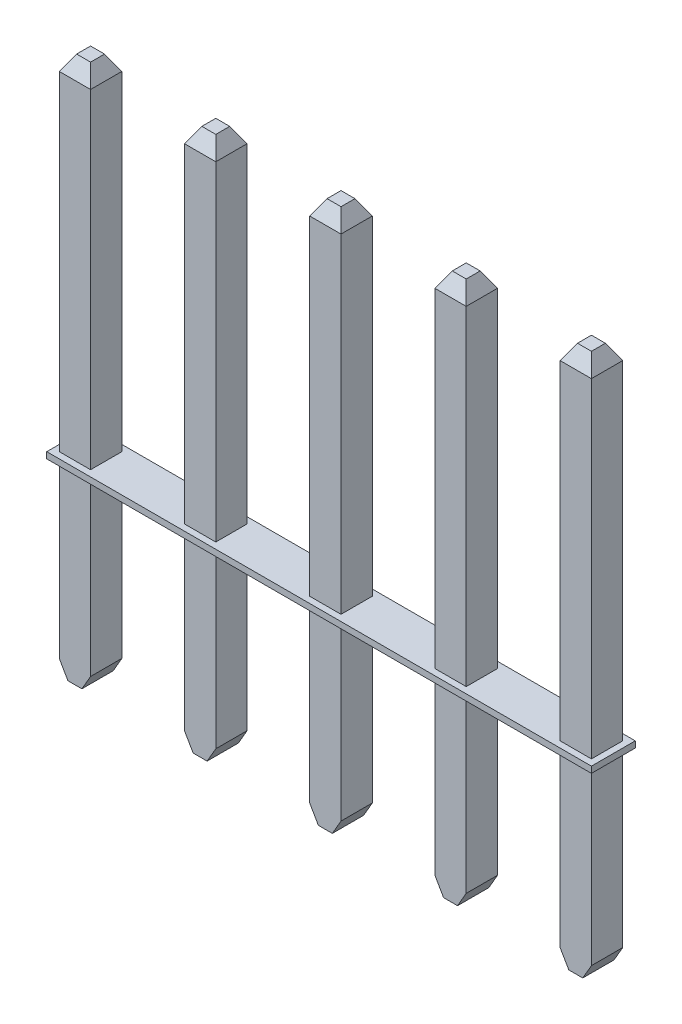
ISO-10303-21;
HEADER;
FILE_DESCRIPTION(('STEP AP214'),'2;1');
FILE_NAME('part.step','',(''),(''),'','','');
FILE_SCHEMA(('AUTOMOTIVE_DESIGN { 1 0 10303 214 1 1 1 1 }'));
ENDSEC;
DATA;
#1=APPLICATION_CONTEXT('core data for automotive mechanical design processes');
#2=APPLICATION_PROTOCOL_DEFINITION('international standard','automotive_design',2000,#1);
#3=PRODUCT_CONTEXT('',#1,'mechanical');
#4=PRODUCT('Part','Part','',(#3));
#5=PRODUCT_RELATED_PRODUCT_CATEGORY('part','',(#4));
#6=PRODUCT_DEFINITION_FORMATION('','',#4);
#7=PRODUCT_DEFINITION_CONTEXT('part definition',#1,'design');
#8=PRODUCT_DEFINITION('design','',#6,#7);
#9=PRODUCT_DEFINITION_SHAPE('','',#8);
#10=(LENGTH_UNIT() NAMED_UNIT(*) SI_UNIT(.MILLI.,.METRE.));
#11=(NAMED_UNIT(*) PLANE_ANGLE_UNIT() SI_UNIT($,.RADIAN.));
#12=(NAMED_UNIT(*) SI_UNIT($,.STERADIAN.) SOLID_ANGLE_UNIT());
#13=UNCERTAINTY_MEASURE_WITH_UNIT(LENGTH_MEASURE(1.E-05),#10,'distance_accuracy_value','');
#14=(GEOMETRIC_REPRESENTATION_CONTEXT(3) GLOBAL_UNCERTAINTY_ASSIGNED_CONTEXT((#13)) GLOBAL_UNIT_ASSIGNED_CONTEXT((#10,
#11,#12)) REPRESENTATION_CONTEXT('',''));
#15=CARTESIAN_POINT('',(0.,0.,0.));
#16=DIRECTION('',(0.,0.,1.));
#17=DIRECTION('',(1.,0.,0.));
#18=AXIS2_PLACEMENT_3D('',#15,#16,#17);
#19=CARTESIAN_POINT('',(-5.3975,0.,0.3175));
#20=DIRECTION('',(0.,1.,0.));
#21=DIRECTION('',(0.,0.,1.));
#22=AXIS2_PLACEMENT_3D('',#19,#20,#21);
#23=PLANE('',#22);
#24=DIRECTION('',(0.,0.,-1.));
#25=VECTOR('',#24,1.);
#26=CARTESIAN_POINT('',(-5.22152363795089,0.,0.3175));
#27=LINE('',#26,#25);
#28=CARTESIAN_POINT('',(-5.22152363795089,0.,0.3175));
#29=VERTEX_POINT('',#28);
#30=CARTESIAN_POINT('',(-5.22152363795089,0.,-0.3175));
#31=VERTEX_POINT('',#30);
#32=EDGE_CURVE('E428',#29,#31,#27,.T.);
#33=ORIENTED_EDGE('',*,*,#32,.T.);
#34=DIRECTION('',(1.,0.,0.));
#35=VECTOR('',#34,1.);
#36=CARTESIAN_POINT('',(-5.22152363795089,0.,-0.3175));
#37=LINE('',#36,#35);
#38=CARTESIAN_POINT('',(-4.93847636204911,0.,-0.3175));
#39=VERTEX_POINT('',#38);
#40=EDGE_CURVE('E416',#31,#39,#37,.T.);
#41=ORIENTED_EDGE('',*,*,#40,.T.);
#42=DIRECTION('',(0.,0.,-1.));
#43=VECTOR('',#42,1.);
#44=CARTESIAN_POINT('',(-4.93847636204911,0.,0.3175));
#45=LINE('',#44,#43);
#46=CARTESIAN_POINT('',(-4.93847636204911,0.,0.3175));
#47=VERTEX_POINT('',#46);
#48=EDGE_CURVE('E427',#47,#39,#45,.T.);
#49=ORIENTED_EDGE('',*,*,#48,.F.);
#50=DIRECTION('',(1.,0.,0.));
#51=VECTOR('',#50,1.);
#52=CARTESIAN_POINT('',(-5.22152363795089,0.,0.3175));
#53=LINE('',#52,#51);
#54=EDGE_CURVE('E437',#29,#47,#53,.T.);
#55=ORIENTED_EDGE('',*,*,#54,.F.);
#56=EDGE_LOOP('',(#33,#41,#49,#55));
#57=FACE_BOUND('',#56,.T.);
#58=ADVANCED_FACE('F17',(#57),#23,.F.);
#59=CARTESIAN_POINT('',(-5.22152363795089,0.,2.54));
#60=DIRECTION('',(-0.866025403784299,-0.500000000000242,0.));
#61=DIRECTION('',(0.500000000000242,-0.866025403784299,0.));
#62=AXIS2_PLACEMENT_3D('',#59,#60,#61);
#63=PLANE('',#62);
#64=DIRECTION('',(0.500000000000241,-0.866025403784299,0.));
#65=VECTOR('',#64,1.);
#66=CARTESIAN_POINT('',(-5.3975,0.304800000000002,-0.3175));
#67=LINE('',#66,#65);
#68=CARTESIAN_POINT('',(-5.3975,0.3048,-0.3175));
#69=VERTEX_POINT('',#68);
#70=EDGE_CURVE('E420',#69,#31,#67,.T.);
#71=ORIENTED_EDGE('',*,*,#70,.T.);
#72=ORIENTED_EDGE('',*,*,#32,.F.);
#73=DIRECTION('',(0.500000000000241,-0.866025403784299,0.));
#74=VECTOR('',#73,1.);
#75=CARTESIAN_POINT('',(-5.3975,0.304800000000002,0.3175));
#76=LINE('',#75,#74);
#77=CARTESIAN_POINT('',(-5.3975,0.3048,0.3175));
#78=VERTEX_POINT('',#77);
#79=EDGE_CURVE('E436',#78,#29,#76,.T.);
#80=ORIENTED_EDGE('',*,*,#79,.F.);
#81=DIRECTION('',(0.,0.,-1.));
#82=VECTOR('',#81,1.);
#83=CARTESIAN_POINT('',(-5.3975,0.3048,0.3175));
#84=LINE('',#83,#82);
#85=EDGE_CURVE('E435',#78,#69,#84,.T.);
#86=ORIENTED_EDGE('',*,*,#85,.T.);
#87=EDGE_LOOP('',(#71,#72,#80,#86));
#88=FACE_BOUND('',#87,.T.);
#89=ADVANCED_FACE('F433',(#88),#63,.T.);
#90=CARTESIAN_POINT('',(0.,0.,-0.3175));
#91=DIRECTION('',(0.,0.,1.));
#92=DIRECTION('',(1.,0.,0.));
#93=AXIS2_PLACEMENT_3D('',#90,#91,#92);
#94=PLANE('',#93);
#95=ORIENTED_EDGE('',*,*,#70,.F.);
#96=DIRECTION('',(0.,-1.,0.));
#97=VECTOR('',#96,1.);
#98=CARTESIAN_POINT('',(-5.3975,3.81,-0.3175));
#99=LINE('',#98,#97);
#100=CARTESIAN_POINT('',(-5.3975,3.81,-0.3175));
#101=VERTEX_POINT('',#100);
#102=EDGE_CURVE('E458',#101,#69,#99,.T.);
#103=ORIENTED_EDGE('',*,*,#102,.F.);
#104=DIRECTION('',(-1.,0.,0.));
#105=VECTOR('',#104,1.);
#106=CARTESIAN_POINT('',(-4.7625,3.81,-0.3175));
#107=LINE('',#106,#105);
#108=CARTESIAN_POINT('',(-4.7625,3.81,-0.3175));
#109=VERTEX_POINT('',#108);
#110=EDGE_CURVE('E462',#109,#101,#107,.T.);
#111=ORIENTED_EDGE('',*,*,#110,.F.);
#112=DIRECTION('',(0.,1.,0.));
#113=VECTOR('',#112,1.);
#114=CARTESIAN_POINT('',(-4.7625,0.3048,-0.3175));
#115=LINE('',#114,#113);
#116=CARTESIAN_POINT('',(-4.7625,0.3048,-0.3175));
#117=VERTEX_POINT('',#116);
#118=EDGE_CURVE('E466',#117,#109,#115,.T.);
#119=ORIENTED_EDGE('',*,*,#118,.F.);
#120=DIRECTION('',(0.500000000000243,0.866025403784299,0.));
#121=VECTOR('',#120,1.);
#122=CARTESIAN_POINT('',(-4.93847636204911,0.,-0.3175));
#123=LINE('',#122,#121);
#124=EDGE_CURVE('E423',#39,#117,#123,.T.);
#125=ORIENTED_EDGE('',*,*,#124,.F.);
#126=ORIENTED_EDGE('',*,*,#40,.F.);
#127=EDGE_LOOP('',(#95,#103,#111,#119,#125,#126));
#128=FACE_BOUND('',#127,.T.);
#129=ADVANCED_FACE('F418',(#128),#94,.F.);
#130=CARTESIAN_POINT('',(-4.7625,0.3048,2.54));
#131=DIRECTION('',(0.866025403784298,-0.500000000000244,0.));
#132=DIRECTION('',(0.500000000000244,0.866025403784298,0.));
#133=AXIS2_PLACEMENT_3D('',#130,#131,#132);
#134=PLANE('',#133);
#135=ORIENTED_EDGE('',*,*,#124,.T.);
#136=DIRECTION('',(0.,0.,-1.));
#137=VECTOR('',#136,1.);
#138=CARTESIAN_POINT('',(-4.7625,0.3048,0.3175));
#139=LINE('',#138,#137);
#140=CARTESIAN_POINT('',(-4.7625,0.3048,0.3175));
#141=VERTEX_POINT('',#140);
#142=EDGE_CURVE('E473',#141,#117,#139,.T.);
#143=ORIENTED_EDGE('',*,*,#142,.F.);
#144=DIRECTION('',(0.500000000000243,0.866025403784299,0.));
#145=VECTOR('',#144,1.);
#146=CARTESIAN_POINT('',(-4.93847636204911,0.,0.3175));
#147=LINE('',#146,#145);
#148=EDGE_CURVE('E477',#47,#141,#147,.T.);
#149=ORIENTED_EDGE('',*,*,#148,.F.);
#150=ORIENTED_EDGE('',*,*,#48,.T.);
#151=EDGE_LOOP('',(#135,#143,#149,#150));
#152=FACE_BOUND('',#151,.T.);
#153=ADVANCED_FACE('F2196',(#152),#134,.T.);
#154=CARTESIAN_POINT('',(0.,0.,0.3175));
#155=DIRECTION('',(0.,0.,1.));
#156=DIRECTION('',(1.,0.,0.));
#157=AXIS2_PLACEMENT_3D('',#154,#155,#156);
#158=PLANE('',#157);
#159=DIRECTION('',(0.,-1.,0.));
#160=VECTOR('',#159,1.);
#161=CARTESIAN_POINT('',(-5.3975,3.81,0.3175));
#162=LINE('',#161,#160);
#163=CARTESIAN_POINT('',(-5.3975,3.81,0.3175));
#164=VERTEX_POINT('',#163);
#165=EDGE_CURVE('E482',#164,#78,#162,.T.);
#166=ORIENTED_EDGE('',*,*,#165,.T.);
#167=ORIENTED_EDGE('',*,*,#79,.T.);
#168=ORIENTED_EDGE('',*,*,#54,.T.);
#169=ORIENTED_EDGE('',*,*,#148,.T.);
#170=DIRECTION('',(0.,1.,0.));
#171=VECTOR('',#170,1.);
#172=CARTESIAN_POINT('',(-4.7625,0.3048,0.3175));
#173=LINE('',#172,#171);
#174=CARTESIAN_POINT('',(-4.7625,3.81,0.3175));
#175=VERTEX_POINT('',#174);
#176=EDGE_CURVE('E487',#141,#175,#173,.T.);
#177=ORIENTED_EDGE('',*,*,#176,.T.);
#178=DIRECTION('',(-1.,0.,0.));
#179=VECTOR('',#178,1.);
#180=CARTESIAN_POINT('',(-4.7625,3.81,0.3175));
#181=LINE('',#180,#179);
#182=EDGE_CURVE('E492',#175,#164,#181,.T.);
#183=ORIENTED_EDGE('',*,*,#182,.T.);
#184=EDGE_LOOP('',(#166,#167,#168,#169,#177,#183));
#185=FACE_BOUND('',#184,.T.);
#186=ADVANCED_FACE('F1833',(#185),#158,.T.);
#187=CARTESIAN_POINT('',(-5.3975,10.922,0.3175));
#188=DIRECTION('',(1.,0.,0.));
#189=DIRECTION('',(0.,0.,-1.));
#190=AXIS2_PLACEMENT_3D('',#187,#188,#189);
#191=PLANE('',#190);
#192=ORIENTED_EDGE('',*,*,#85,.F.);
#193=ORIENTED_EDGE('',*,*,#165,.F.);
#194=DIRECTION('',(0.,0.,1.));
#195=VECTOR('',#194,1.);
#196=CARTESIAN_POINT('',(-5.3975,3.81,-0.3175));
#197=LINE('',#196,#195);
#198=EDGE_CURVE('E497',#101,#164,#197,.T.);
#199=ORIENTED_EDGE('',*,*,#198,.F.);
#200=ORIENTED_EDGE('',*,*,#102,.T.);
#201=EDGE_LOOP('',(#192,#193,#199,#200));
#202=FACE_BOUND('',#201,.T.);
#203=ADVANCED_FACE('F1932',(#202),#191,.F.);
#204=CARTESIAN_POINT('',(5.5245,3.81,0.4445));
#205=DIRECTION('',(0.,1.,0.));
#206=DIRECTION('',(0.,0.,1.));
#207=AXIS2_PLACEMENT_3D('',#204,#205,#206);
#208=PLANE('',#207);
#209=ORIENTED_EDGE('',*,*,#182,.F.);
#210=DIRECTION('',(0.,0.,-1.));
#211=VECTOR('',#210,1.);
#212=CARTESIAN_POINT('',(-4.7625,3.81,0.3175));
#213=LINE('',#212,#211);
#214=EDGE_CURVE('E501',#175,#109,#213,.T.);
#215=ORIENTED_EDGE('',*,*,#214,.T.);
#216=ORIENTED_EDGE('',*,*,#110,.T.);
#217=ORIENTED_EDGE('',*,*,#198,.T.);
#218=EDGE_LOOP('',(#209,#215,#216,#217));
#219=FACE_BOUND('',#218,.T.);
#220=DIRECTION('',(-1.,0.,0.));
#221=VECTOR('',#220,1.);
#222=CARTESIAN_POINT('',(5.3975,3.81,-0.3175));
#223=LINE('',#222,#221);
#224=CARTESIAN_POINT('',(5.3975,3.81,-0.3175));
#225=VERTEX_POINT('',#224);
#226=CARTESIAN_POINT('',(4.7625,3.81,-0.3175));
#227=VERTEX_POINT('',#226);
#228=EDGE_CURVE('E506',#225,#227,#223,.T.);
#229=ORIENTED_EDGE('',*,*,#228,.T.);
#230=DIRECTION('',(0.,0.,-1.));
#231=VECTOR('',#230,1.);
#232=CARTESIAN_POINT('',(4.7625,3.81,0.3175));
#233=LINE('',#232,#231);
#234=CARTESIAN_POINT('',(4.7625,3.81,0.3175));
#235=VERTEX_POINT('',#234);
#236=EDGE_CURVE('E511',#235,#227,#233,.T.);
#237=ORIENTED_EDGE('',*,*,#236,.F.);
#238=DIRECTION('',(-1.,0.,0.));
#239=VECTOR('',#238,1.);
#240=CARTESIAN_POINT('',(5.3975,3.81,0.3175));
#241=LINE('',#240,#239);
#242=CARTESIAN_POINT('',(5.3975,3.81,0.3175));
#243=VERTEX_POINT('',#242);
#244=EDGE_CURVE('E515',#243,#235,#241,.T.);
#245=ORIENTED_EDGE('',*,*,#244,.F.);
#246=DIRECTION('',(0.,0.,-1.));
#247=VECTOR('',#246,1.);
#248=CARTESIAN_POINT('',(5.3975,3.81,0.3175));
#249=LINE('',#248,#247);
#250=EDGE_CURVE('E519',#243,#225,#249,.T.);
#251=ORIENTED_EDGE('',*,*,#250,.T.);
#252=EDGE_LOOP('',(#229,#237,#245,#251));
#253=FACE_BOUND('',#252,.T.);
#254=DIRECTION('',(-1.,0.,0.));
#255=VECTOR('',#254,1.);
#256=CARTESIAN_POINT('',(2.8575,3.81,0.3175));
#257=LINE('',#256,#255);
#258=CARTESIAN_POINT('',(2.8575,3.81,0.3175));
#259=VERTEX_POINT('',#258);
#260=CARTESIAN_POINT('',(2.2225,3.81,0.3175));
#261=VERTEX_POINT('',#260);
#262=EDGE_CURVE('E524',#259,#261,#257,.T.);
#263=ORIENTED_EDGE('',*,*,#262,.F.);
#264=DIRECTION('',(0.,0.,-1.));
#265=VECTOR('',#264,1.);
#266=CARTESIAN_POINT('',(2.8575,3.81,0.3175));
#267=LINE('',#266,#265);
#268=CARTESIAN_POINT('',(2.8575,3.81,-0.3175));
#269=VERTEX_POINT('',#268);
#270=EDGE_CURVE('E529',#259,#269,#267,.T.);
#271=ORIENTED_EDGE('',*,*,#270,.T.);
#272=DIRECTION('',(-1.,0.,0.));
#273=VECTOR('',#272,1.);
#274=CARTESIAN_POINT('',(2.8575,3.81,-0.3175));
#275=LINE('',#274,#273);
#276=CARTESIAN_POINT('',(2.2225,3.81,-0.3175));
#277=VERTEX_POINT('',#276);
#278=EDGE_CURVE('E534',#269,#277,#275,.T.);
#279=ORIENTED_EDGE('',*,*,#278,.T.);
#280=DIRECTION('',(0.,0.,-1.));
#281=VECTOR('',#280,1.);
#282=CARTESIAN_POINT('',(2.2225,3.81,0.3175));
#283=LINE('',#282,#281);
#284=EDGE_CURVE('E539',#261,#277,#283,.T.);
#285=ORIENTED_EDGE('',*,*,#284,.F.);
#286=EDGE_LOOP('',(#263,#271,#279,#285));
#287=FACE_BOUND('',#286,.T.);
#288=DIRECTION('',(-1.,0.,0.));
#289=VECTOR('',#288,1.);
#290=CARTESIAN_POINT('',(0.3175,3.81,0.3175));
#291=LINE('',#290,#289);
#292=CARTESIAN_POINT('',(0.3175,3.81,0.3175));
#293=VERTEX_POINT('',#292);
#294=CARTESIAN_POINT('',(-0.3175,3.81,0.3175));
#295=VERTEX_POINT('',#294);
#296=EDGE_CURVE('E543',#293,#295,#291,.T.);
#297=ORIENTED_EDGE('',*,*,#296,.F.);
#298=DIRECTION('',(0.,0.,-1.));
#299=VECTOR('',#298,1.);
#300=CARTESIAN_POINT('',(0.3175,3.81,0.3175));
#301=LINE('',#300,#299);
#302=CARTESIAN_POINT('',(0.3175,3.81,-0.3175));
#303=VERTEX_POINT('',#302);
#304=EDGE_CURVE('E548',#293,#303,#301,.T.);
#305=ORIENTED_EDGE('',*,*,#304,.T.);
#306=DIRECTION('',(-1.,0.,0.));
#307=VECTOR('',#306,1.);
#308=CARTESIAN_POINT('',(0.3175,3.81,-0.3175));
#309=LINE('',#308,#307);
#310=CARTESIAN_POINT('',(-0.3175,3.81,-0.3175));
#311=VERTEX_POINT('',#310);
#312=EDGE_CURVE('E553',#303,#311,#309,.T.);
#313=ORIENTED_EDGE('',*,*,#312,.T.);
#314=DIRECTION('',(0.,0.,-1.));
#315=VECTOR('',#314,1.);
#316=CARTESIAN_POINT('',(-0.3175,3.81,0.3175));
#317=LINE('',#316,#315);
#318=EDGE_CURVE('E558',#295,#311,#317,.T.);
#319=ORIENTED_EDGE('',*,*,#318,.F.);
#320=EDGE_LOOP('',(#297,#305,#313,#319));
#321=FACE_BOUND('',#320,.T.);
#322=DIRECTION('',(-1.,0.,0.));
#323=VECTOR('',#322,1.);
#324=CARTESIAN_POINT('',(-2.2225,3.81,0.3175));
#325=LINE('',#324,#323);
#326=CARTESIAN_POINT('',(-2.2225,3.81,0.3175));
#327=VERTEX_POINT('',#326);
#328=CARTESIAN_POINT('',(-2.8575,3.81,0.3175));
#329=VERTEX_POINT('',#328);
#330=EDGE_CURVE('E562',#327,#329,#325,.T.);
#331=ORIENTED_EDGE('',*,*,#330,.F.);
#332=DIRECTION('',(0.,0.,-1.));
#333=VECTOR('',#332,1.);
#334=CARTESIAN_POINT('',(-2.2225,3.81,0.3175));
#335=LINE('',#334,#333);
#336=CARTESIAN_POINT('',(-2.2225,3.81,-0.3175));
#337=VERTEX_POINT('',#336);
#338=EDGE_CURVE('E567',#327,#337,#335,.T.);
#339=ORIENTED_EDGE('',*,*,#338,.T.);
#340=DIRECTION('',(-1.,0.,0.));
#341=VECTOR('',#340,1.);
#342=CARTESIAN_POINT('',(-2.2225,3.81,-0.3175));
#343=LINE('',#342,#341);
#344=CARTESIAN_POINT('',(-2.8575,3.81,-0.3175));
#345=VERTEX_POINT('',#344);
#346=EDGE_CURVE('E572',#337,#345,#343,.T.);
#347=ORIENTED_EDGE('',*,*,#346,.T.);
#348=DIRECTION('',(0.,0.,-1.));
#349=VECTOR('',#348,1.);
#350=CARTESIAN_POINT('',(-2.8575,3.81,0.3175));
#351=LINE('',#350,#349);
#352=EDGE_CURVE('E577',#329,#345,#351,.T.);
#353=ORIENTED_EDGE('',*,*,#352,.F.);
#354=EDGE_LOOP('',(#331,#339,#347,#353));
#355=FACE_BOUND('',#354,.T.);
#356=DIRECTION('',(0.,0.,-1.));
#357=VECTOR('',#356,1.);
#358=CARTESIAN_POINT('',(-5.5245,3.81,0.4445));
#359=LINE('',#358,#357);
#360=CARTESIAN_POINT('',(-5.5245,3.81,0.4445));
#361=VERTEX_POINT('',#360);
#362=CARTESIAN_POINT('',(-5.5245,3.81,-0.4445));
#363=VERTEX_POINT('',#362);
#364=EDGE_CURVE('E581',#361,#363,#359,.T.);
#365=ORIENTED_EDGE('',*,*,#364,.T.);
#366=DIRECTION('',(-1.,0.,0.));
#367=VECTOR('',#366,1.);
#368=CARTESIAN_POINT('',(5.5245,3.81,-0.4445));
#369=LINE('',#368,#367);
#370=CARTESIAN_POINT('',(5.5245,3.81,-0.4445));
#371=VERTEX_POINT('',#370);
#372=EDGE_CURVE('E586',#371,#363,#369,.T.);
#373=ORIENTED_EDGE('',*,*,#372,.F.);
#374=DIRECTION('',(0.,0.,-1.));
#375=VECTOR('',#374,1.);
#376=CARTESIAN_POINT('',(5.5245,3.81,0.4445));
#377=LINE('',#376,#375);
#378=CARTESIAN_POINT('',(5.5245,3.81,0.4445));
#379=VERTEX_POINT('',#378);
#380=EDGE_CURVE('E590',#379,#371,#377,.T.);
#381=ORIENTED_EDGE('',*,*,#380,.F.);
#382=DIRECTION('',(-1.,0.,0.));
#383=VECTOR('',#382,1.);
#384=CARTESIAN_POINT('',(5.5245,3.81,0.4445));
#385=LINE('',#384,#383);
#386=EDGE_CURVE('E594',#379,#361,#385,.T.);
#387=ORIENTED_EDGE('',*,*,#386,.T.);
#388=EDGE_LOOP('',(#365,#373,#381,#387));
#389=FACE_BOUND('',#388,.T.);
#390=ADVANCED_FACE('F1478',(#219,#253,#287,#321,#355,#389),#208,.F.);
#391=CARTESIAN_POINT('',(-4.7625,3.81,2.54));
#392=DIRECTION('',(1.,0.,0.));
#393=DIRECTION('',(0.,0.,-1.));
#394=AXIS2_PLACEMENT_3D('',#391,#392,#393);
#395=PLANE('',#394);
#396=ORIENTED_EDGE('',*,*,#176,.F.);
#397=ORIENTED_EDGE('',*,*,#142,.T.);
#398=ORIENTED_EDGE('',*,*,#118,.T.);
#399=ORIENTED_EDGE('',*,*,#214,.F.);
#400=EDGE_LOOP('',(#396,#397,#398,#399));
#401=FACE_BOUND('',#400,.T.);
#402=ADVANCED_FACE('F2161',(#401),#395,.T.);
#403=DIRECTION('',(0.500000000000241,0.866025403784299,0.));
#404=VECTOR('',#403,1.);
#405=CARTESIAN_POINT('',(5.22152363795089,0.,-0.3175));
#406=LINE('',#405,#404);
#407=CARTESIAN_POINT('',(5.22152363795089,0.,-0.3175));
#408=VERTEX_POINT('',#407);
#409=CARTESIAN_POINT('',(5.3975,0.3048,-0.3175));
#410=VERTEX_POINT('',#409);
#411=EDGE_CURVE('E599',#408,#410,#406,.T.);
#412=ORIENTED_EDGE('',*,*,#411,.F.);
#413=DIRECTION('',(1.,0.,0.));
#414=VECTOR('',#413,1.);
#415=CARTESIAN_POINT('',(4.93847636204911,0.,-0.3175));
#416=LINE('',#415,#414);
#417=CARTESIAN_POINT('',(4.93847636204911,0.,-0.3175));
#418=VERTEX_POINT('',#417);
#419=EDGE_CURVE('E603',#418,#408,#416,.T.);
#420=ORIENTED_EDGE('',*,*,#419,.F.);
#421=DIRECTION('',(0.500000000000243,-0.866025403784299,0.));
#422=VECTOR('',#421,1.);
#423=CARTESIAN_POINT('',(4.7625,0.3048,-0.3175));
#424=LINE('',#423,#422);
#425=CARTESIAN_POINT('',(4.7625,0.3048,-0.3175));
#426=VERTEX_POINT('',#425);
#427=EDGE_CURVE('E607',#426,#418,#424,.T.);
#428=ORIENTED_EDGE('',*,*,#427,.F.);
#429=DIRECTION('',(0.,-1.,0.));
#430=VECTOR('',#429,1.);
#431=CARTESIAN_POINT('',(4.7625,3.81,-0.3175));
#432=LINE('',#431,#430);
#433=EDGE_CURVE('E611',#227,#426,#432,.T.);
#434=ORIENTED_EDGE('',*,*,#433,.F.);
#435=ORIENTED_EDGE('',*,*,#228,.F.);
#436=DIRECTION('',(0.,1.,0.));
#437=VECTOR('',#436,1.);
#438=CARTESIAN_POINT('',(5.3975,0.3048,-0.3175));
#439=LINE('',#438,#437);
#440=EDGE_CURVE('E616',#410,#225,#439,.T.);
#441=ORIENTED_EDGE('',*,*,#440,.F.);
#442=EDGE_LOOP('',(#412,#420,#428,#434,#435,#441));
#443=FACE_BOUND('',#442,.T.);
#444=ADVANCED_FACE('F2110',(#443),#94,.F.);
#445=CARTESIAN_POINT('',(4.7625,-7.112,2.54));
#446=DIRECTION('',(-1.,0.,0.));
#447=DIRECTION('',(0.,0.,1.));
#448=AXIS2_PLACEMENT_3D('',#445,#446,#447);
#449=PLANE('',#448);
#450=ORIENTED_EDGE('',*,*,#433,.T.);
#451=DIRECTION('',(0.,0.,-1.));
#452=VECTOR('',#451,1.);
#453=CARTESIAN_POINT('',(4.7625,0.3048,0.3175));
#454=LINE('',#453,#452);
#455=CARTESIAN_POINT('',(4.7625,0.3048,0.3175));
#456=VERTEX_POINT('',#455);
#457=EDGE_CURVE('E620',#456,#426,#454,.T.);
#458=ORIENTED_EDGE('',*,*,#457,.F.);
#459=DIRECTION('',(0.,-1.,0.));
#460=VECTOR('',#459,1.);
#461=CARTESIAN_POINT('',(4.7625,3.81,0.3175));
#462=LINE('',#461,#460);
#463=EDGE_CURVE('E624',#235,#456,#462,.T.);
#464=ORIENTED_EDGE('',*,*,#463,.F.);
#465=ORIENTED_EDGE('',*,*,#236,.T.);
#466=EDGE_LOOP('',(#450,#458,#464,#465));
#467=FACE_BOUND('',#466,.T.);
#468=ADVANCED_FACE('F2143',(#467),#449,.T.);
#469=DIRECTION('',(1.,0.,0.));
#470=VECTOR('',#469,1.);
#471=CARTESIAN_POINT('',(4.93847636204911,0.,0.3175));
#472=LINE('',#471,#470);
#473=CARTESIAN_POINT('',(4.93847636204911,0.,0.3175));
#474=VERTEX_POINT('',#473);
#475=CARTESIAN_POINT('',(5.22152363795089,0.,0.3175));
#476=VERTEX_POINT('',#475);
#477=EDGE_CURVE('E629',#474,#476,#472,.T.);
#478=ORIENTED_EDGE('',*,*,#477,.T.);
#479=DIRECTION('',(0.500000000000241,0.866025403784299,0.));
#480=VECTOR('',#479,1.);
#481=CARTESIAN_POINT('',(5.22152363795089,0.,0.3175));
#482=LINE('',#481,#480);
#483=CARTESIAN_POINT('',(5.3975,0.3048,0.3175));
#484=VERTEX_POINT('',#483);
#485=EDGE_CURVE('E634',#476,#484,#482,.T.);
#486=ORIENTED_EDGE('',*,*,#485,.T.);
#487=DIRECTION('',(0.,1.,0.));
#488=VECTOR('',#487,1.);
#489=CARTESIAN_POINT('',(5.3975,0.3048,0.3175));
#490=LINE('',#489,#488);
#491=EDGE_CURVE('E639',#484,#243,#490,.T.);
#492=ORIENTED_EDGE('',*,*,#491,.T.);
#493=ORIENTED_EDGE('',*,*,#244,.T.);
#494=ORIENTED_EDGE('',*,*,#463,.T.);
#495=DIRECTION('',(0.500000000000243,-0.866025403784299,0.));
#496=VECTOR('',#495,1.);
#497=CARTESIAN_POINT('',(4.7625,0.3048,0.3175));
#498=LINE('',#497,#496);
#499=EDGE_CURVE('E644',#456,#474,#498,.T.);
#500=ORIENTED_EDGE('',*,*,#499,.T.);
#501=EDGE_LOOP('',(#478,#486,#492,#493,#494,#500));
#502=FACE_BOUND('',#501,.T.);
#503=ADVANCED_FACE('F2127',(#502),#158,.T.);
#504=CARTESIAN_POINT('',(5.3975,0.,0.3175));
#505=DIRECTION('',(-1.,0.,0.));
#506=DIRECTION('',(0.,0.,1.));
#507=AXIS2_PLACEMENT_3D('',#504,#505,#506);
#508=PLANE('',#507);
#509=DIRECTION('',(0.,0.,-1.));
#510=VECTOR('',#509,1.);
#511=CARTESIAN_POINT('',(5.3975,0.3048,0.3175));
#512=LINE('',#511,#510);
#513=EDGE_CURVE('E649',#484,#410,#512,.T.);
#514=ORIENTED_EDGE('',*,*,#513,.T.);
#515=ORIENTED_EDGE('',*,*,#440,.T.);
#516=ORIENTED_EDGE('',*,*,#250,.F.);
#517=ORIENTED_EDGE('',*,*,#491,.F.);
#518=EDGE_LOOP('',(#514,#515,#516,#517));
#519=FACE_BOUND('',#518,.T.);
#520=ADVANCED_FACE('F1812',(#519),#508,.F.);
#521=DIRECTION('',(1.,0.,0.));
#522=VECTOR('',#521,1.);
#523=CARTESIAN_POINT('',(2.39847636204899,0.,0.3175));
#524=LINE('',#523,#522);
#525=CARTESIAN_POINT('',(2.39847636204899,0.,0.3175));
#526=VERTEX_POINT('',#525);
#527=CARTESIAN_POINT('',(2.68152363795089,0.,0.3175));
#528=VERTEX_POINT('',#527);
#529=EDGE_CURVE('E654',#526,#528,#524,.T.);
#530=ORIENTED_EDGE('',*,*,#529,.T.);
#531=DIRECTION('',(0.500000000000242,0.866025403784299,0.));
#532=VECTOR('',#531,1.);
#533=CARTESIAN_POINT('',(2.68152363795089,0.,0.3175));
#534=LINE('',#533,#532);
#535=CARTESIAN_POINT('',(2.8575,0.3048,0.3175));
#536=VERTEX_POINT('',#535);
#537=EDGE_CURVE('E659',#528,#536,#534,.T.);
#538=ORIENTED_EDGE('',*,*,#537,.T.);
#539=DIRECTION('',(0.,1.,0.));
#540=VECTOR('',#539,1.);
#541=CARTESIAN_POINT('',(2.8575,0.3048,0.3175));
#542=LINE('',#541,#540);
#543=EDGE_CURVE('E664',#536,#259,#542,.T.);
#544=ORIENTED_EDGE('',*,*,#543,.T.);
#545=ORIENTED_EDGE('',*,*,#262,.T.);
#546=DIRECTION('',(0.,-1.,0.));
#547=VECTOR('',#546,1.);
#548=CARTESIAN_POINT('',(2.2225,3.81,0.3175));
#549=LINE('',#548,#547);
#550=CARTESIAN_POINT('',(2.2225,0.3048,0.3175));
#551=VERTEX_POINT('',#550);
#552=EDGE_CURVE('E669',#261,#551,#549,.T.);
#553=ORIENTED_EDGE('',*,*,#552,.T.);
#554=DIRECTION('',(0.499999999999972,-0.866025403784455,0.));
#555=VECTOR('',#554,1.);
#556=CARTESIAN_POINT('',(2.2225,0.304799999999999,0.3175));
#557=LINE('',#556,#555);
#558=EDGE_CURVE('E674',#551,#526,#557,.T.);
#559=ORIENTED_EDGE('',*,*,#558,.T.);
#560=EDGE_LOOP('',(#530,#538,#544,#545,#553,#559));
#561=FACE_BOUND('',#560,.T.);
#562=ADVANCED_FACE('F1493',(#561),#158,.T.);
#563=CARTESIAN_POINT('',(2.8575,3.81,2.54));
#564=DIRECTION('',(1.,0.,0.));
#565=DIRECTION('',(0.,0.,-1.));
#566=AXIS2_PLACEMENT_3D('',#563,#564,#565);
#567=PLANE('',#566);
#568=ORIENTED_EDGE('',*,*,#543,.F.);
#569=DIRECTION('',(0.,0.,-1.));
#570=VECTOR('',#569,1.);
#571=CARTESIAN_POINT('',(2.8575,0.3048,0.3175));
#572=LINE('',#571,#570);
#573=CARTESIAN_POINT('',(2.8575,0.3048,-0.3175));
#574=VERTEX_POINT('',#573);
#575=EDGE_CURVE('E679',#536,#574,#572,.T.);
#576=ORIENTED_EDGE('',*,*,#575,.T.);
#577=DIRECTION('',(0.,1.,0.));
#578=VECTOR('',#577,1.);
#579=CARTESIAN_POINT('',(2.8575,0.3048,-0.3175));
#580=LINE('',#579,#578);
#581=EDGE_CURVE('E684',#574,#269,#580,.T.);
#582=ORIENTED_EDGE('',*,*,#581,.T.);
#583=ORIENTED_EDGE('',*,*,#270,.F.);
#584=EDGE_LOOP('',(#568,#576,#582,#583));
#585=FACE_BOUND('',#584,.T.);
#586=ADVANCED_FACE('F2108',(#585),#567,.T.);
#587=DIRECTION('',(0.500000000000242,0.866025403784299,0.));
#588=VECTOR('',#587,1.);
#589=CARTESIAN_POINT('',(2.68152363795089,0.,-0.3175));
#590=LINE('',#589,#588);
#591=CARTESIAN_POINT('',(2.68152363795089,0.,-0.3175));
#592=VERTEX_POINT('',#591);
#593=EDGE_CURVE('E689',#592,#574,#590,.T.);
#594=ORIENTED_EDGE('',*,*,#593,.F.);
#595=DIRECTION('',(1.,0.,0.));
#596=VECTOR('',#595,1.);
#597=CARTESIAN_POINT('',(2.39847636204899,0.,-0.3175));
#598=LINE('',#597,#596);
#599=CARTESIAN_POINT('',(2.39847636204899,0.,-0.3175));
#600=VERTEX_POINT('',#599);
#601=EDGE_CURVE('E693',#600,#592,#598,.T.);
#602=ORIENTED_EDGE('',*,*,#601,.F.);
#603=DIRECTION('',(0.499999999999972,-0.866025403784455,0.));
#604=VECTOR('',#603,1.);
#605=CARTESIAN_POINT('',(2.2225,0.304799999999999,-0.3175));
#606=LINE('',#605,#604);
#607=CARTESIAN_POINT('',(2.2225,0.3048,-0.3175));
#608=VERTEX_POINT('',#607);
#609=EDGE_CURVE('E698',#608,#600,#606,.T.);
#610=ORIENTED_EDGE('',*,*,#609,.F.);
#611=DIRECTION('',(0.,-1.,0.));
#612=VECTOR('',#611,1.);
#613=CARTESIAN_POINT('',(2.2225,3.81,-0.3175));
#614=LINE('',#613,#612);
#615=EDGE_CURVE('E702',#277,#608,#614,.T.);
#616=ORIENTED_EDGE('',*,*,#615,.F.);
#617=ORIENTED_EDGE('',*,*,#278,.F.);
#618=ORIENTED_EDGE('',*,*,#581,.F.);
#619=EDGE_LOOP('',(#594,#602,#610,#616,#617,#618));
#620=FACE_BOUND('',#619,.T.);
#621=ADVANCED_FACE('F1489',(#620),#94,.F.);
#622=CARTESIAN_POINT('',(2.2225,0.,2.54));
#623=DIRECTION('',(-1.,0.,0.));
#624=DIRECTION('',(0.,0.,1.));
#625=AXIS2_PLACEMENT_3D('',#622,#623,#624);
#626=PLANE('',#625);
#627=ORIENTED_EDGE('',*,*,#615,.T.);
#628=DIRECTION('',(0.,0.,-1.));
#629=VECTOR('',#628,1.);
#630=CARTESIAN_POINT('',(2.2225,0.3048,0.3175));
#631=LINE('',#630,#629);
#632=EDGE_CURVE('E707',#551,#608,#631,.T.);
#633=ORIENTED_EDGE('',*,*,#632,.F.);
#634=ORIENTED_EDGE('',*,*,#552,.F.);
#635=ORIENTED_EDGE('',*,*,#284,.T.);
#636=EDGE_LOOP('',(#627,#633,#634,#635));
#637=FACE_BOUND('',#636,.T.);
#638=ADVANCED_FACE('F1491',(#637),#626,.T.);
#639=DIRECTION('',(1.,0.,0.));
#640=VECTOR('',#639,1.);
#641=CARTESIAN_POINT('',(-0.141523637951,0.,0.3175));
#642=LINE('',#641,#640);
#643=CARTESIAN_POINT('',(-0.141523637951,0.,0.3175));
#644=VERTEX_POINT('',#643);
#645=CARTESIAN_POINT('',(0.141523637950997,0.,0.3175));
#646=VERTEX_POINT('',#645);
#647=EDGE_CURVE('E711',#644,#646,#642,.T.);
#648=ORIENTED_EDGE('',*,*,#647,.T.);
#649=DIRECTION('',(0.500000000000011,0.866025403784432,0.));
#650=VECTOR('',#649,1.);
#651=CARTESIAN_POINT('',(0.141523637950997,0.,0.3175));
#652=LINE('',#651,#650);
#653=CARTESIAN_POINT('',(0.3175,0.3048,0.3175));
#654=VERTEX_POINT('',#653);
#655=EDGE_CURVE('E716',#646,#654,#652,.T.);
#656=ORIENTED_EDGE('',*,*,#655,.T.);
#657=DIRECTION('',(0.,1.,0.));
#658=VECTOR('',#657,1.);
#659=CARTESIAN_POINT('',(0.3175,0.3048,0.3175));
#660=LINE('',#659,#658);
#661=EDGE_CURVE('E721',#654,#293,#660,.T.);
#662=ORIENTED_EDGE('',*,*,#661,.T.);
#663=ORIENTED_EDGE('',*,*,#296,.T.);
#664=DIRECTION('',(0.,-1.,0.));
#665=VECTOR('',#664,1.);
#666=CARTESIAN_POINT('',(-0.3175,3.81,0.3175));
#667=LINE('',#666,#665);
#668=CARTESIAN_POINT('',(-0.3175,0.3048,0.3175));
#669=VERTEX_POINT('',#668);
#670=EDGE_CURVE('E726',#295,#669,#667,.T.);
#671=ORIENTED_EDGE('',*,*,#670,.T.);
#672=DIRECTION('',(0.500000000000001,-0.866025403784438,0.));
#673=VECTOR('',#672,1.);
#674=CARTESIAN_POINT('',(-0.317499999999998,0.304800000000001,0.3175));
#675=LINE('',#674,#673);
#676=EDGE_CURVE('E731',#669,#644,#675,.T.);
#677=ORIENTED_EDGE('',*,*,#676,.T.);
#678=EDGE_LOOP('',(#648,#656,#662,#663,#671,#677));
#679=FACE_BOUND('',#678,.T.);
#680=ADVANCED_FACE('F1464',(#679),#158,.T.);
#681=CARTESIAN_POINT('',(0.3175,3.81,2.54));
#682=DIRECTION('',(1.,0.,0.));
#683=DIRECTION('',(0.,0.,-1.));
#684=AXIS2_PLACEMENT_3D('',#681,#682,#683);
#685=PLANE('',#684);
#686=ORIENTED_EDGE('',*,*,#661,.F.);
#687=DIRECTION('',(0.,0.,-1.));
#688=VECTOR('',#687,1.);
#689=CARTESIAN_POINT('',(0.3175,0.3048,0.3175));
#690=LINE('',#689,#688);
#691=CARTESIAN_POINT('',(0.3175,0.3048,-0.3175));
#692=VERTEX_POINT('',#691);
#693=EDGE_CURVE('E736',#654,#692,#690,.T.);
#694=ORIENTED_EDGE('',*,*,#693,.T.);
#695=DIRECTION('',(0.,1.,0.));
#696=VECTOR('',#695,1.);
#697=CARTESIAN_POINT('',(0.3175,0.3048,-0.3175));
#698=LINE('',#697,#696);
#699=EDGE_CURVE('E741',#692,#303,#698,.T.);
#700=ORIENTED_EDGE('',*,*,#699,.T.);
#701=ORIENTED_EDGE('',*,*,#304,.F.);
#702=EDGE_LOOP('',(#686,#694,#700,#701));
#703=FACE_BOUND('',#702,.T.);
#704=ADVANCED_FACE('F1481',(#703),#685,.T.);
#705=DIRECTION('',(0.500000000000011,0.866025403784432,0.));
#706=VECTOR('',#705,1.);
#707=CARTESIAN_POINT('',(0.141523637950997,0.,-0.3175));
#708=LINE('',#707,#706);
#709=CARTESIAN_POINT('',(0.141523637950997,0.,-0.3175));
#710=VERTEX_POINT('',#709);
#711=EDGE_CURVE('E746',#710,#692,#708,.T.);
#712=ORIENTED_EDGE('',*,*,#711,.F.);
#713=DIRECTION('',(1.,0.,0.));
#714=VECTOR('',#713,1.);
#715=CARTESIAN_POINT('',(-0.141523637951,0.,-0.3175));
#716=LINE('',#715,#714);
#717=CARTESIAN_POINT('',(-0.141523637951,0.,-0.3175));
#718=VERTEX_POINT('',#717);
#719=EDGE_CURVE('E750',#718,#710,#716,.T.);
#720=ORIENTED_EDGE('',*,*,#719,.F.);
#721=DIRECTION('',(0.500000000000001,-0.866025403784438,0.));
#722=VECTOR('',#721,1.);
#723=CARTESIAN_POINT('',(-0.317499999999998,0.304800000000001,-0.3175));
#724=LINE('',#723,#722);
#725=CARTESIAN_POINT('',(-0.3175,0.3048,-0.3175));
#726=VERTEX_POINT('',#725);
#727=EDGE_CURVE('E755',#726,#718,#724,.T.);
#728=ORIENTED_EDGE('',*,*,#727,.F.);
#729=DIRECTION('',(0.,-1.,0.));
#730=VECTOR('',#729,1.);
#731=CARTESIAN_POINT('',(-0.3175,3.81,-0.3175));
#732=LINE('',#731,#730);
#733=EDGE_CURVE('E759',#311,#726,#732,.T.);
#734=ORIENTED_EDGE('',*,*,#733,.F.);
#735=ORIENTED_EDGE('',*,*,#312,.F.);
#736=ORIENTED_EDGE('',*,*,#699,.F.);
#737=EDGE_LOOP('',(#712,#720,#728,#734,#735,#736));
#738=FACE_BOUND('',#737,.T.);
#739=ADVANCED_FACE('F1474',(#738),#94,.F.);
#740=CARTESIAN_POINT('',(-0.3175,0.,2.54));
#741=DIRECTION('',(-1.,0.,0.));
#742=DIRECTION('',(0.,0.,1.));
#743=AXIS2_PLACEMENT_3D('',#740,#741,#742);
#744=PLANE('',#743);
#745=ORIENTED_EDGE('',*,*,#733,.T.);
#746=DIRECTION('',(0.,0.,-1.));
#747=VECTOR('',#746,1.);
#748=CARTESIAN_POINT('',(-0.3175,0.3048,0.3175));
#749=LINE('',#748,#747);
#750=EDGE_CURVE('E764',#669,#726,#749,.T.);
#751=ORIENTED_EDGE('',*,*,#750,.F.);
#752=ORIENTED_EDGE('',*,*,#670,.F.);
#753=ORIENTED_EDGE('',*,*,#318,.T.);
#754=EDGE_LOOP('',(#745,#751,#752,#753));
#755=FACE_BOUND('',#754,.T.);
#756=ADVANCED_FACE('F1470',(#755),#744,.T.);
#757=DIRECTION('',(1.,0.,0.));
#758=VECTOR('',#757,1.);
#759=CARTESIAN_POINT('',(-2.68152363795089,0.,0.3175));
#760=LINE('',#759,#758);
#761=CARTESIAN_POINT('',(-2.68152363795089,0.,0.3175));
#762=VERTEX_POINT('',#761);
#763=CARTESIAN_POINT('',(-2.39847636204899,0.,0.3175));
#764=VERTEX_POINT('',#763);
#765=EDGE_CURVE('E768',#762,#764,#760,.T.);
#766=ORIENTED_EDGE('',*,*,#765,.T.);
#767=DIRECTION('',(0.499999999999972,0.866025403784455,0.));
#768=VECTOR('',#767,1.);
#769=CARTESIAN_POINT('',(-2.39847636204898,0.,0.3175));
#770=LINE('',#769,#768);
#771=CARTESIAN_POINT('',(-2.2225,0.3048,0.3175));
#772=VERTEX_POINT('',#771);
#773=EDGE_CURVE('E773',#764,#772,#770,.T.);
#774=ORIENTED_EDGE('',*,*,#773,.T.);
#775=DIRECTION('',(0.,1.,0.));
#776=VECTOR('',#775,1.);
#777=CARTESIAN_POINT('',(-2.2225,0.3048,0.3175));
#778=LINE('',#777,#776);
#779=EDGE_CURVE('E778',#772,#327,#778,.T.);
#780=ORIENTED_EDGE('',*,*,#779,.T.);
#781=ORIENTED_EDGE('',*,*,#330,.T.);
#782=DIRECTION('',(0.,-1.,0.));
#783=VECTOR('',#782,1.);
#784=CARTESIAN_POINT('',(-2.8575,3.81,0.3175));
#785=LINE('',#784,#783);
#786=CARTESIAN_POINT('',(-2.8575,0.3048,0.3175));
#787=VERTEX_POINT('',#786);
#788=EDGE_CURVE('E783',#329,#787,#785,.T.);
#789=ORIENTED_EDGE('',*,*,#788,.T.);
#790=DIRECTION('',(0.500000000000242,-0.866025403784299,0.));
#791=VECTOR('',#790,1.);
#792=CARTESIAN_POINT('',(-2.8575,0.304800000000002,0.3175));
#793=LINE('',#792,#791);
#794=EDGE_CURVE('E788',#787,#762,#793,.T.);
#795=ORIENTED_EDGE('',*,*,#794,.T.);
#796=EDGE_LOOP('',(#766,#774,#780,#781,#789,#795));
#797=FACE_BOUND('',#796,.T.);
#798=ADVANCED_FACE('F1494',(#797),#158,.T.);
#799=CARTESIAN_POINT('',(-2.2225,3.81,2.54));
#800=DIRECTION('',(1.,0.,0.));
#801=DIRECTION('',(0.,0.,-1.));
#802=AXIS2_PLACEMENT_3D('',#799,#800,#801);
#803=PLANE('',#802);
#804=ORIENTED_EDGE('',*,*,#779,.F.);
#805=DIRECTION('',(0.,0.,-1.));
#806=VECTOR('',#805,1.);
#807=CARTESIAN_POINT('',(-2.2225,0.3048,0.3175));
#808=LINE('',#807,#806);
#809=CARTESIAN_POINT('',(-2.2225,0.3048,-0.3175));
#810=VERTEX_POINT('',#809);
#811=EDGE_CURVE('E793',#772,#810,#808,.T.);
#812=ORIENTED_EDGE('',*,*,#811,.T.);
#813=DIRECTION('',(0.,1.,0.));
#814=VECTOR('',#813,1.);
#815=CARTESIAN_POINT('',(-2.2225,0.3048,-0.3175));
#816=LINE('',#815,#814);
#817=EDGE_CURVE('E798',#810,#337,#816,.T.);
#818=ORIENTED_EDGE('',*,*,#817,.T.);
#819=ORIENTED_EDGE('',*,*,#338,.F.);
#820=EDGE_LOOP('',(#804,#812,#818,#819));
#821=FACE_BOUND('',#820,.T.);
#822=ADVANCED_FACE('F1500',(#821),#803,.T.);
#823=DIRECTION('',(0.499999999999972,0.866025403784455,0.));
#824=VECTOR('',#823,1.);
#825=CARTESIAN_POINT('',(-2.39847636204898,0.,-0.3175));
#826=LINE('',#825,#824);
#827=CARTESIAN_POINT('',(-2.39847636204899,0.,-0.3175));
#828=VERTEX_POINT('',#827);
#829=EDGE_CURVE('E803',#828,#810,#826,.T.);
#830=ORIENTED_EDGE('',*,*,#829,.F.);
#831=DIRECTION('',(1.,0.,0.));
#832=VECTOR('',#831,1.);
#833=CARTESIAN_POINT('',(-2.68152363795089,0.,-0.3175));
#834=LINE('',#833,#832);
#835=CARTESIAN_POINT('',(-2.68152363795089,0.,-0.3175));
#836=VERTEX_POINT('',#835);
#837=EDGE_CURVE('E807',#836,#828,#834,.T.);
#838=ORIENTED_EDGE('',*,*,#837,.F.);
#839=DIRECTION('',(0.500000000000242,-0.866025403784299,0.));
#840=VECTOR('',#839,1.);
#841=CARTESIAN_POINT('',(-2.8575,0.304800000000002,-0.3175));
#842=LINE('',#841,#840);
#843=CARTESIAN_POINT('',(-2.8575,0.3048,-0.3175));
#844=VERTEX_POINT('',#843);
#845=EDGE_CURVE('E812',#844,#836,#842,.T.);
#846=ORIENTED_EDGE('',*,*,#845,.F.);
#847=DIRECTION('',(0.,-1.,0.));
#848=VECTOR('',#847,1.);
#849=CARTESIAN_POINT('',(-2.8575,3.81,-0.3175));
#850=LINE('',#849,#848);
#851=EDGE_CURVE('E816',#345,#844,#850,.T.);
#852=ORIENTED_EDGE('',*,*,#851,.F.);
#853=ORIENTED_EDGE('',*,*,#346,.F.);
#854=ORIENTED_EDGE('',*,*,#817,.F.);
#855=EDGE_LOOP('',(#830,#838,#846,#852,#853,#854));
#856=FACE_BOUND('',#855,.T.);
#857=ADVANCED_FACE('F1490',(#856),#94,.F.);
#858=CARTESIAN_POINT('',(-2.8575,0.,2.54));
#859=DIRECTION('',(-1.,0.,0.));
#860=DIRECTION('',(0.,0.,1.));
#861=AXIS2_PLACEMENT_3D('',#858,#859,#860);
#862=PLANE('',#861);
#863=ORIENTED_EDGE('',*,*,#851,.T.);
#864=DIRECTION('',(0.,0.,-1.));
#865=VECTOR('',#864,1.);
#866=CARTESIAN_POINT('',(-2.8575,0.3048,0.3175));
#867=LINE('',#866,#865);
#868=EDGE_CURVE('E821',#787,#844,#867,.T.);
#869=ORIENTED_EDGE('',*,*,#868,.F.);
#870=ORIENTED_EDGE('',*,*,#788,.F.);
#871=ORIENTED_EDGE('',*,*,#352,.T.);
#872=EDGE_LOOP('',(#863,#869,#870,#871));
#873=FACE_BOUND('',#872,.T.);
#874=ADVANCED_FACE('F1504',(#873),#862,.T.);
#875=CARTESIAN_POINT('',(-5.5245,0.,0.));
#876=DIRECTION('',(1.,0.,0.));
#877=DIRECTION('',(0.,0.,-1.));
#878=AXIS2_PLACEMENT_3D('',#875,#876,#877);
#879=PLANE('',#878);
#880=DIRECTION('',(0.,0.,1.));
#881=VECTOR('',#880,1.);
#882=CARTESIAN_POINT('',(-5.5245,3.937,-0.4445));
#883=LINE('',#882,#881);
#884=CARTESIAN_POINT('',(-5.5245,3.937,-0.4445));
#885=VERTEX_POINT('',#884);
#886=CARTESIAN_POINT('',(-5.5245,3.937,0.4445));
#887=VERTEX_POINT('',#886);
#888=EDGE_CURVE('E825',#885,#887,#883,.T.);
#889=ORIENTED_EDGE('',*,*,#888,.F.);
#890=DIRECTION('',(0.,1.,0.));
#891=VECTOR('',#890,1.);
#892=CARTESIAN_POINT('',(-5.5245,3.81,-0.4445));
#893=LINE('',#892,#891);
#894=EDGE_CURVE('E829',#363,#885,#893,.T.);
#895=ORIENTED_EDGE('',*,*,#894,.F.);
#896=ORIENTED_EDGE('',*,*,#364,.F.);
#897=DIRECTION('',(0.,-1.,0.));
#898=VECTOR('',#897,1.);
#899=CARTESIAN_POINT('',(-5.5245,3.937,0.4445));
#900=LINE('',#899,#898);
#901=EDGE_CURVE('E834',#887,#361,#900,.T.);
#902=ORIENTED_EDGE('',*,*,#901,.F.);
#903=EDGE_LOOP('',(#889,#895,#896,#902));
#904=FACE_BOUND('',#903,.T.);
#905=ADVANCED_FACE('F1507',(#904),#879,.F.);
#906=CARTESIAN_POINT('',(5.5245,3.81,-0.4445));
#907=DIRECTION('',(0.,0.,1.));
#908=DIRECTION('',(1.,0.,0.));
#909=AXIS2_PLACEMENT_3D('',#906,#907,#908);
#910=PLANE('',#909);
#911=ORIENTED_EDGE('',*,*,#894,.T.);
#912=DIRECTION('',(-1.,0.,0.));
#913=VECTOR('',#912,1.);
#914=CARTESIAN_POINT('',(5.5245,3.937,-0.4445));
#915=LINE('',#914,#913);
#916=CARTESIAN_POINT('',(5.5245,3.937,-0.4445));
#917=VERTEX_POINT('',#916);
#918=EDGE_CURVE('E838',#917,#885,#915,.T.);
#919=ORIENTED_EDGE('',*,*,#918,.F.);
#920=DIRECTION('',(0.,1.,0.));
#921=VECTOR('',#920,1.);
#922=CARTESIAN_POINT('',(5.5245,3.81,-0.4445));
#923=LINE('',#922,#921);
#924=EDGE_CURVE('E842',#371,#917,#923,.T.);
#925=ORIENTED_EDGE('',*,*,#924,.F.);
#926=ORIENTED_EDGE('',*,*,#372,.T.);
#927=EDGE_LOOP('',(#911,#919,#925,#926));
#928=FACE_BOUND('',#927,.T.);
#929=ADVANCED_FACE('F1511',(#928),#910,.F.);
#930=CARTESIAN_POINT('',(5.5245,0.,0.));
#931=DIRECTION('',(1.,0.,0.));
#932=DIRECTION('',(0.,0.,-1.));
#933=AXIS2_PLACEMENT_3D('',#930,#931,#932);
#934=PLANE('',#933);
#935=DIRECTION('',(0.,0.,1.));
#936=VECTOR('',#935,1.);
#937=CARTESIAN_POINT('',(5.5245,3.937,-0.4445));
#938=LINE('',#937,#936);
#939=CARTESIAN_POINT('',(5.5245,3.937,0.4445));
#940=VERTEX_POINT('',#939);
#941=EDGE_CURVE('E847',#917,#940,#938,.T.);
#942=ORIENTED_EDGE('',*,*,#941,.T.);
#943=DIRECTION('',(0.,-1.,0.));
#944=VECTOR('',#943,1.);
#945=CARTESIAN_POINT('',(5.5245,3.937,0.4445));
#946=LINE('',#945,#944);
#947=EDGE_CURVE('E852',#940,#379,#946,.T.);
#948=ORIENTED_EDGE('',*,*,#947,.T.);
#949=ORIENTED_EDGE('',*,*,#380,.T.);
#950=ORIENTED_EDGE('',*,*,#924,.T.);
#951=EDGE_LOOP('',(#942,#948,#949,#950));
#952=FACE_BOUND('',#951,.T.);
#953=ADVANCED_FACE('F1515',(#952),#934,.T.);
#954=CARTESIAN_POINT('',(5.5245,3.937,0.4445));
#955=DIRECTION('',(0.,0.,-1.));
#956=DIRECTION('',(-1.,0.,0.));
#957=AXIS2_PLACEMENT_3D('',#954,#955,#956);
#958=PLANE('',#957);
#959=ORIENTED_EDGE('',*,*,#901,.T.);
#960=ORIENTED_EDGE('',*,*,#386,.F.);
#961=ORIENTED_EDGE('',*,*,#947,.F.);
#962=DIRECTION('',(-1.,0.,0.));
#963=VECTOR('',#962,1.);
#964=CARTESIAN_POINT('',(5.5245,3.937,0.4445));
#965=LINE('',#964,#963);
#966=EDGE_CURVE('E857',#940,#887,#965,.T.);
#967=ORIENTED_EDGE('',*,*,#966,.T.);
#968=EDGE_LOOP('',(#959,#960,#961,#967));
#969=FACE_BOUND('',#968,.T.);
#970=ADVANCED_FACE('F1435',(#969),#958,.F.);
#971=CARTESIAN_POINT('',(5.3975,0.3048,2.54));
#972=DIRECTION('',(0.866025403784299,-0.500000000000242,0.));
#973=DIRECTION('',(0.500000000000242,0.866025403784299,0.));
#974=AXIS2_PLACEMENT_3D('',#971,#972,#973);
#975=PLANE('',#974);
#976=ORIENTED_EDGE('',*,*,#411,.T.);
#977=ORIENTED_EDGE('',*,*,#513,.F.);
#978=ORIENTED_EDGE('',*,*,#485,.F.);
#979=DIRECTION('',(0.,0.,-1.));
#980=VECTOR('',#979,1.);
#981=CARTESIAN_POINT('',(5.22152363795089,0.,0.3175));
#982=LINE('',#981,#980);
#983=EDGE_CURVE('E862',#476,#408,#982,.T.);
#984=ORIENTED_EDGE('',*,*,#983,.T.);
#985=EDGE_LOOP('',(#976,#977,#978,#984));
#986=FACE_BOUND('',#985,.T.);
#987=ADVANCED_FACE('F1426',(#986),#975,.T.);
#988=ORIENTED_EDGE('',*,*,#983,.F.);
#989=ORIENTED_EDGE('',*,*,#477,.F.);
#990=DIRECTION('',(0.,0.,-1.));
#991=VECTOR('',#990,1.);
#992=CARTESIAN_POINT('',(4.93847636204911,0.,0.3175));
#993=LINE('',#992,#991);
#994=EDGE_CURVE('E867',#474,#418,#993,.T.);
#995=ORIENTED_EDGE('',*,*,#994,.T.);
#996=ORIENTED_EDGE('',*,*,#419,.T.);
#997=EDGE_LOOP('',(#988,#989,#995,#996));
#998=FACE_BOUND('',#997,.T.);
#999=ADVANCED_FACE('F1414',(#998),#23,.F.);
#1000=CARTESIAN_POINT('',(4.93847636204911,0.,2.54));
#1001=DIRECTION('',(-0.866025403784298,-0.500000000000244,0.));
#1002=DIRECTION('',(0.500000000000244,-0.866025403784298,0.));
#1003=AXIS2_PLACEMENT_3D('',#1000,#1001,#1002);
#1004=PLANE('',#1003);
#1005=ORIENTED_EDGE('',*,*,#427,.T.);
#1006=ORIENTED_EDGE('',*,*,#994,.F.);
#1007=ORIENTED_EDGE('',*,*,#499,.F.);
#1008=ORIENTED_EDGE('',*,*,#457,.T.);
#1009=EDGE_LOOP('',(#1005,#1006,#1007,#1008));
#1010=FACE_BOUND('',#1009,.T.);
#1011=ADVANCED_FACE('F1425',(#1010),#1004,.T.);
#1012=DIRECTION('',(0.,0.,-1.));
#1013=VECTOR('',#1012,1.);
#1014=CARTESIAN_POINT('',(2.68152363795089,0.,0.3175));
#1015=LINE('',#1014,#1013);
#1016=EDGE_CURVE('E872',#528,#592,#1015,.T.);
#1017=ORIENTED_EDGE('',*,*,#1016,.F.);
#1018=ORIENTED_EDGE('',*,*,#529,.F.);
#1019=DIRECTION('',(0.,0.,-1.));
#1020=VECTOR('',#1019,1.);
#1021=CARTESIAN_POINT('',(2.39847636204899,0.,0.3175));
#1022=LINE('',#1021,#1020);
#1023=EDGE_CURVE('E876',#526,#600,#1022,.T.);
#1024=ORIENTED_EDGE('',*,*,#1023,.T.);
#1025=ORIENTED_EDGE('',*,*,#601,.T.);
#1026=EDGE_LOOP('',(#1017,#1018,#1024,#1025));
#1027=FACE_BOUND('',#1026,.T.);
#1028=ADVANCED_FACE('F1428',(#1027),#23,.F.);
#1029=CARTESIAN_POINT('',(2.8575,0.3048,2.54));
#1030=DIRECTION('',(0.866025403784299,-0.500000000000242,0.));
#1031=DIRECTION('',(0.500000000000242,0.866025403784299,0.));
#1032=AXIS2_PLACEMENT_3D('',#1029,#1030,#1031);
#1033=PLANE('',#1032);
#1034=ORIENTED_EDGE('',*,*,#593,.T.);
#1035=ORIENTED_EDGE('',*,*,#575,.F.);
#1036=ORIENTED_EDGE('',*,*,#537,.F.);
#1037=ORIENTED_EDGE('',*,*,#1016,.T.);
#1038=EDGE_LOOP('',(#1034,#1035,#1036,#1037));
#1039=FACE_BOUND('',#1038,.T.);
#1040=ADVANCED_FACE('F1439',(#1039),#1033,.T.);
#1041=CARTESIAN_POINT('',(2.39847636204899,0.,2.54));
#1042=DIRECTION('',(-0.866025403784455,-0.499999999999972,0.));
#1043=DIRECTION('',(0.499999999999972,-0.866025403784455,0.));
#1044=AXIS2_PLACEMENT_3D('',#1041,#1042,#1043);
#1045=PLANE('',#1044);
#1046=ORIENTED_EDGE('',*,*,#609,.T.);
#1047=ORIENTED_EDGE('',*,*,#1023,.F.);
#1048=ORIENTED_EDGE('',*,*,#558,.F.);
#1049=ORIENTED_EDGE('',*,*,#632,.T.);
#1050=EDGE_LOOP('',(#1046,#1047,#1048,#1049));
#1051=FACE_BOUND('',#1050,.T.);
#1052=ADVANCED_FACE('F1444',(#1051),#1045,.T.);
#1053=DIRECTION('',(0.,0.,-1.));
#1054=VECTOR('',#1053,1.);
#1055=CARTESIAN_POINT('',(0.141523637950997,0.,0.3175));
#1056=LINE('',#1055,#1054);
#1057=EDGE_CURVE('E881',#646,#710,#1056,.T.);
#1058=ORIENTED_EDGE('',*,*,#1057,.F.);
#1059=ORIENTED_EDGE('',*,*,#647,.F.);
#1060=DIRECTION('',(0.,0.,-1.));
#1061=VECTOR('',#1060,1.);
#1062=CARTESIAN_POINT('',(-0.141523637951,0.,0.3175));
#1063=LINE('',#1062,#1061);
#1064=EDGE_CURVE('E885',#644,#718,#1063,.T.);
#1065=ORIENTED_EDGE('',*,*,#1064,.T.);
#1066=ORIENTED_EDGE('',*,*,#719,.T.);
#1067=EDGE_LOOP('',(#1058,#1059,#1065,#1066));
#1068=FACE_BOUND('',#1067,.T.);
#1069=ADVANCED_FACE('F1423',(#1068),#23,.F.);
#1070=CARTESIAN_POINT('',(0.3175,0.3048,2.54));
#1071=DIRECTION('',(0.866025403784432,-0.500000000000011,0.));
#1072=DIRECTION('',(0.500000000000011,0.866025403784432,0.));
#1073=AXIS2_PLACEMENT_3D('',#1070,#1071,#1072);
#1074=PLANE('',#1073);
#1075=ORIENTED_EDGE('',*,*,#711,.T.);
#1076=ORIENTED_EDGE('',*,*,#693,.F.);
#1077=ORIENTED_EDGE('',*,*,#655,.F.);
#1078=ORIENTED_EDGE('',*,*,#1057,.T.);
#1079=EDGE_LOOP('',(#1075,#1076,#1077,#1078));
#1080=FACE_BOUND('',#1079,.T.);
#1081=ADVANCED_FACE('F1449',(#1080),#1074,.T.);
#1082=CARTESIAN_POINT('',(-0.141523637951,0.,2.54));
#1083=DIRECTION('',(-0.866025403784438,-0.500000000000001,0.));
#1084=DIRECTION('',(0.500000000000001,-0.866025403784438,0.));
#1085=AXIS2_PLACEMENT_3D('',#1082,#1083,#1084);
#1086=PLANE('',#1085);
#1087=ORIENTED_EDGE('',*,*,#727,.T.);
#1088=ORIENTED_EDGE('',*,*,#1064,.F.);
#1089=ORIENTED_EDGE('',*,*,#676,.F.);
#1090=ORIENTED_EDGE('',*,*,#750,.T.);
#1091=EDGE_LOOP('',(#1087,#1088,#1089,#1090));
#1092=FACE_BOUND('',#1091,.T.);
#1093=ADVANCED_FACE('F1421',(#1092),#1086,.T.);
#1094=DIRECTION('',(0.,0.,-1.));
#1095=VECTOR('',#1094,1.);
#1096=CARTESIAN_POINT('',(-2.39847636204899,0.,0.3175));
#1097=LINE('',#1096,#1095);
#1098=EDGE_CURVE('E890',#764,#828,#1097,.T.);
#1099=ORIENTED_EDGE('',*,*,#1098,.F.);
#1100=ORIENTED_EDGE('',*,*,#765,.F.);
#1101=DIRECTION('',(0.,0.,-1.));
#1102=VECTOR('',#1101,1.);
#1103=CARTESIAN_POINT('',(-2.68152363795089,0.,0.3175));
#1104=LINE('',#1103,#1102);
#1105=EDGE_CURVE('E894',#762,#836,#1104,.T.);
#1106=ORIENTED_EDGE('',*,*,#1105,.T.);
#1107=ORIENTED_EDGE('',*,*,#837,.T.);
#1108=EDGE_LOOP('',(#1099,#1100,#1106,#1107));
#1109=FACE_BOUND('',#1108,.T.);
#1110=ADVANCED_FACE('F1413',(#1109),#23,.F.);
#1111=CARTESIAN_POINT('',(-2.2225,0.3048,2.54));
#1112=DIRECTION('',(0.866025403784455,-0.499999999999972,0.));
#1113=DIRECTION('',(0.499999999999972,0.866025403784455,0.));
#1114=AXIS2_PLACEMENT_3D('',#1111,#1112,#1113);
#1115=PLANE('',#1114);
#1116=ORIENTED_EDGE('',*,*,#829,.T.);
#1117=ORIENTED_EDGE('',*,*,#811,.F.);
#1118=ORIENTED_EDGE('',*,*,#773,.F.);
#1119=ORIENTED_EDGE('',*,*,#1098,.T.);
#1120=EDGE_LOOP('',(#1116,#1117,#1118,#1119));
#1121=FACE_BOUND('',#1120,.T.);
#1122=ADVANCED_FACE('F1420',(#1121),#1115,.T.);
#1123=CARTESIAN_POINT('',(-2.68152363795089,0.,2.54));
#1124=DIRECTION('',(-0.866025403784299,-0.500000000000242,0.));
#1125=DIRECTION('',(0.500000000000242,-0.866025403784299,0.));
#1126=AXIS2_PLACEMENT_3D('',#1123,#1124,#1125);
#1127=PLANE('',#1126);
#1128=ORIENTED_EDGE('',*,*,#845,.T.);
#1129=ORIENTED_EDGE('',*,*,#1105,.F.);
#1130=ORIENTED_EDGE('',*,*,#794,.F.);
#1131=ORIENTED_EDGE('',*,*,#868,.T.);
#1132=EDGE_LOOP('',(#1128,#1129,#1130,#1131));
#1133=FACE_BOUND('',#1132,.T.);
#1134=ADVANCED_FACE('F1527',(#1133),#1127,.T.);
#1135=CARTESIAN_POINT('',(5.5245,3.937,-0.4445));
#1136=DIRECTION('',(0.,-1.,0.));
#1137=DIRECTION('',(0.,0.,-1.));
#1138=AXIS2_PLACEMENT_3D('',#1135,#1136,#1137);
#1139=PLANE('',#1138);
#1140=DIRECTION('',(0.,0.,-1.));
#1141=VECTOR('',#1140,1.);
#1142=CARTESIAN_POINT('',(-4.7625,3.937,0.3175));
#1143=LINE('',#1142,#1141);
#1144=CARTESIAN_POINT('',(-4.7625,3.937,0.3175));
#1145=VERTEX_POINT('',#1144);
#1146=CARTESIAN_POINT('',(-4.7625,3.937,-0.3175));
#1147=VERTEX_POINT('',#1146);
#1148=EDGE_CURVE('E899',#1145,#1147,#1143,.T.);
#1149=ORIENTED_EDGE('',*,*,#1148,.F.);
#1150=DIRECTION('',(1.,0.,0.));
#1151=VECTOR('',#1150,1.);
#1152=CARTESIAN_POINT('',(-5.3975,3.937,0.3175));
#1153=LINE('',#1152,#1151);
#1154=CARTESIAN_POINT('',(-5.3975,3.937,0.3175));
#1155=VERTEX_POINT('',#1154);
#1156=EDGE_CURVE('E904',#1155,#1145,#1153,.T.);
#1157=ORIENTED_EDGE('',*,*,#1156,.F.);
#1158=DIRECTION('',(0.,0.,-1.));
#1159=VECTOR('',#1158,1.);
#1160=CARTESIAN_POINT('',(-5.3975,3.937,0.3175));
#1161=LINE('',#1160,#1159);
#1162=CARTESIAN_POINT('',(-5.3975,3.937,-0.3175));
#1163=VERTEX_POINT('',#1162);
#1164=EDGE_CURVE('E908',#1155,#1163,#1161,.T.);
#1165=ORIENTED_EDGE('',*,*,#1164,.T.);
#1166=DIRECTION('',(1.,0.,0.));
#1167=VECTOR('',#1166,1.);
#1168=CARTESIAN_POINT('',(-5.3975,3.937,-0.3175));
#1169=LINE('',#1168,#1167);
#1170=EDGE_CURVE('E913',#1163,#1147,#1169,.T.);
#1171=ORIENTED_EDGE('',*,*,#1170,.T.);
#1172=EDGE_LOOP('',(#1149,#1157,#1165,#1171));
#1173=FACE_BOUND('',#1172,.T.);
#1174=DIRECTION('',(0.,0.,-1.));
#1175=VECTOR('',#1174,1.);
#1176=CARTESIAN_POINT('',(-2.2225,3.937,0.3175));
#1177=LINE('',#1176,#1175);
#1178=CARTESIAN_POINT('',(-2.2225,3.937,0.3175));
#1179=VERTEX_POINT('',#1178);
#1180=CARTESIAN_POINT('',(-2.2225,3.937,-0.3175));
#1181=VERTEX_POINT('',#1180);
#1182=EDGE_CURVE('E918',#1179,#1181,#1177,.T.);
#1183=ORIENTED_EDGE('',*,*,#1182,.F.);
#1184=DIRECTION('',(1.,0.,0.));
#1185=VECTOR('',#1184,1.);
#1186=CARTESIAN_POINT('',(-2.8575,3.937,0.3175));
#1187=LINE('',#1186,#1185);
#1188=CARTESIAN_POINT('',(-2.8575,3.937,0.3175));
#1189=VERTEX_POINT('',#1188);
#1190=EDGE_CURVE('E923',#1189,#1179,#1187,.T.);
#1191=ORIENTED_EDGE('',*,*,#1190,.F.);
#1192=DIRECTION('',(0.,0.,-1.));
#1193=VECTOR('',#1192,1.);
#1194=CARTESIAN_POINT('',(-2.8575,3.937,0.3175));
#1195=LINE('',#1194,#1193);
#1196=CARTESIAN_POINT('',(-2.8575,3.937,-0.3175));
#1197=VERTEX_POINT('',#1196);
#1198=EDGE_CURVE('E927',#1189,#1197,#1195,.T.);
#1199=ORIENTED_EDGE('',*,*,#1198,.T.);
#1200=DIRECTION('',(1.,0.,0.));
#1201=VECTOR('',#1200,1.);
#1202=CARTESIAN_POINT('',(-2.8575,3.937,-0.3175));
#1203=LINE('',#1202,#1201);
#1204=EDGE_CURVE('E932',#1197,#1181,#1203,.T.);
#1205=ORIENTED_EDGE('',*,*,#1204,.T.);
#1206=EDGE_LOOP('',(#1183,#1191,#1199,#1205));
#1207=FACE_BOUND('',#1206,.T.);
#1208=DIRECTION('',(0.,0.,-1.));
#1209=VECTOR('',#1208,1.);
#1210=CARTESIAN_POINT('',(0.3175,3.937,0.3175));
#1211=LINE('',#1210,#1209);
#1212=CARTESIAN_POINT('',(0.3175,3.937,0.3175));
#1213=VERTEX_POINT('',#1212);
#1214=CARTESIAN_POINT('',(0.3175,3.937,-0.3175));
#1215=VERTEX_POINT('',#1214);
#1216=EDGE_CURVE('E937',#1213,#1215,#1211,.T.);
#1217=ORIENTED_EDGE('',*,*,#1216,.F.);
#1218=DIRECTION('',(1.,0.,0.));
#1219=VECTOR('',#1218,1.);
#1220=CARTESIAN_POINT('',(-0.3175,3.937,0.3175));
#1221=LINE('',#1220,#1219);
#1222=CARTESIAN_POINT('',(-0.3175,3.937,0.3175));
#1223=VERTEX_POINT('',#1222);
#1224=EDGE_CURVE('E942',#1223,#1213,#1221,.T.);
#1225=ORIENTED_EDGE('',*,*,#1224,.F.);
#1226=DIRECTION('',(0.,0.,-1.));
#1227=VECTOR('',#1226,1.);
#1228=CARTESIAN_POINT('',(-0.3175,3.937,0.3175));
#1229=LINE('',#1228,#1227);
#1230=CARTESIAN_POINT('',(-0.3175,3.937,-0.3175));
#1231=VERTEX_POINT('',#1230);
#1232=EDGE_CURVE('E946',#1223,#1231,#1229,.T.);
#1233=ORIENTED_EDGE('',*,*,#1232,.T.);
#1234=DIRECTION('',(1.,0.,0.));
#1235=VECTOR('',#1234,1.);
#1236=CARTESIAN_POINT('',(-0.3175,3.937,-0.3175));
#1237=LINE('',#1236,#1235);
#1238=EDGE_CURVE('E951',#1231,#1215,#1237,.T.);
#1239=ORIENTED_EDGE('',*,*,#1238,.T.);
#1240=EDGE_LOOP('',(#1217,#1225,#1233,#1239));
#1241=FACE_BOUND('',#1240,.T.);
#1242=DIRECTION('',(0.,0.,-1.));
#1243=VECTOR('',#1242,1.);
#1244=CARTESIAN_POINT('',(2.8575,3.937,0.3175));
#1245=LINE('',#1244,#1243);
#1246=CARTESIAN_POINT('',(2.8575,3.937,0.3175));
#1247=VERTEX_POINT('',#1246);
#1248=CARTESIAN_POINT('',(2.8575,3.937,-0.3175));
#1249=VERTEX_POINT('',#1248);
#1250=EDGE_CURVE('E956',#1247,#1249,#1245,.T.);
#1251=ORIENTED_EDGE('',*,*,#1250,.F.);
#1252=DIRECTION('',(1.,0.,0.));
#1253=VECTOR('',#1252,1.);
#1254=CARTESIAN_POINT('',(2.2225,3.937,0.3175));
#1255=LINE('',#1254,#1253);
#1256=CARTESIAN_POINT('',(2.2225,3.937,0.3175));
#1257=VERTEX_POINT('',#1256);
#1258=EDGE_CURVE('E961',#1257,#1247,#1255,.T.);
#1259=ORIENTED_EDGE('',*,*,#1258,.F.);
#1260=DIRECTION('',(0.,0.,-1.));
#1261=VECTOR('',#1260,1.);
#1262=CARTESIAN_POINT('',(2.2225,3.937,0.3175));
#1263=LINE('',#1262,#1261);
#1264=CARTESIAN_POINT('',(2.2225,3.937,-0.3175));
#1265=VERTEX_POINT('',#1264);
#1266=EDGE_CURVE('E965',#1257,#1265,#1263,.T.);
#1267=ORIENTED_EDGE('',*,*,#1266,.T.);
#1268=DIRECTION('',(1.,0.,0.));
#1269=VECTOR('',#1268,1.);
#1270=CARTESIAN_POINT('',(2.2225,3.937,-0.3175));
#1271=LINE('',#1270,#1269);
#1272=EDGE_CURVE('E970',#1265,#1249,#1271,.T.);
#1273=ORIENTED_EDGE('',*,*,#1272,.T.);
#1274=EDGE_LOOP('',(#1251,#1259,#1267,#1273));
#1275=FACE_BOUND('',#1274,.T.);
#1276=DIRECTION('',(1.,0.,0.));
#1277=VECTOR('',#1276,1.);
#1278=CARTESIAN_POINT('',(4.7625,3.937,0.3175));
#1279=LINE('',#1278,#1277);
#1280=CARTESIAN_POINT('',(4.7625,3.937,0.3175));
#1281=VERTEX_POINT('',#1280);
#1282=CARTESIAN_POINT('',(5.3975,3.937,0.3175));
#1283=VERTEX_POINT('',#1282);
#1284=EDGE_CURVE('E975',#1281,#1283,#1279,.T.);
#1285=ORIENTED_EDGE('',*,*,#1284,.F.);
#1286=DIRECTION('',(0.,0.,-1.));
#1287=VECTOR('',#1286,1.);
#1288=CARTESIAN_POINT('',(4.7625,3.937,0.3175));
#1289=LINE('',#1288,#1287);
#1290=CARTESIAN_POINT('',(4.7625,3.937,-0.3175));
#1291=VERTEX_POINT('',#1290);
#1292=EDGE_CURVE('E980',#1281,#1291,#1289,.T.);
#1293=ORIENTED_EDGE('',*,*,#1292,.T.);
#1294=DIRECTION('',(1.,0.,0.));
#1295=VECTOR('',#1294,1.);
#1296=CARTESIAN_POINT('',(4.7625,3.937,-0.3175));
#1297=LINE('',#1296,#1295);
#1298=CARTESIAN_POINT('',(5.3975,3.937,-0.3175));
#1299=VERTEX_POINT('',#1298);
#1300=EDGE_CURVE('E985',#1291,#1299,#1297,.T.);
#1301=ORIENTED_EDGE('',*,*,#1300,.T.);
#1302=DIRECTION('',(0.,0.,1.));
#1303=VECTOR('',#1302,1.);
#1304=CARTESIAN_POINT('',(5.3975,3.937,-0.3175));
#1305=LINE('',#1304,#1303);
#1306=EDGE_CURVE('E990',#1299,#1283,#1305,.T.);
#1307=ORIENTED_EDGE('',*,*,#1306,.T.);
#1308=EDGE_LOOP('',(#1285,#1293,#1301,#1307));
#1309=FACE_BOUND('',#1308,.T.);
#1310=ORIENTED_EDGE('',*,*,#918,.T.);
#1311=ORIENTED_EDGE('',*,*,#888,.T.);
#1312=ORIENTED_EDGE('',*,*,#966,.F.);
#1313=ORIENTED_EDGE('',*,*,#941,.F.);
#1314=EDGE_LOOP('',(#1310,#1311,#1312,#1313));
#1315=FACE_BOUND('',#1314,.T.);
#1316=ADVANCED_FACE('F1384',(#1173,#1207,#1241,#1275,#1309,#1315),#1139,.F.);
#1317=CARTESIAN_POINT('',(-4.7625,14.859,2.54));
#1318=DIRECTION('',(1.,0.,0.));
#1319=DIRECTION('',(0.,0.,-1.));
#1320=AXIS2_PLACEMENT_3D('',#1317,#1318,#1319);
#1321=PLANE('',#1320);
#1322=DIRECTION('',(0.,1.,0.));
#1323=VECTOR('',#1322,1.);
#1324=CARTESIAN_POINT('',(-4.7625,3.937,-0.3175));
#1325=LINE('',#1324,#1323);
#1326=CARTESIAN_POINT('',(-4.7625,10.6172,-0.3175));
#1327=VERTEX_POINT('',#1326);
#1328=EDGE_CURVE('E995',#1147,#1327,#1325,.T.);
#1329=ORIENTED_EDGE('',*,*,#1328,.T.);
#1330=DIRECTION('',(0.,0.,-1.));
#1331=VECTOR('',#1330,1.);
#1332=CARTESIAN_POINT('',(-4.7625,10.6172,0.3175));
#1333=LINE('',#1332,#1331);
#1334=CARTESIAN_POINT('',(-4.7625,10.6172,0.3175));
#1335=VERTEX_POINT('',#1334);
#1336=EDGE_CURVE('E1000',#1335,#1327,#1333,.T.);
#1337=ORIENTED_EDGE('',*,*,#1336,.F.);
#1338=DIRECTION('',(0.,1.,0.));
#1339=VECTOR('',#1338,1.);
#1340=CARTESIAN_POINT('',(-4.7625,3.937,0.3175));
#1341=LINE('',#1340,#1339);
#1342=EDGE_CURVE('E1005',#1145,#1335,#1341,.T.);
#1343=ORIENTED_EDGE('',*,*,#1342,.F.);
#1344=ORIENTED_EDGE('',*,*,#1148,.T.);
#1345=EDGE_LOOP('',(#1329,#1337,#1343,#1344));
#1346=FACE_BOUND('',#1345,.T.);
#1347=ADVANCED_FACE('F1534',(#1346),#1321,.T.);
#1348=ORIENTED_EDGE('',*,*,#1342,.T.);
#1349=DIRECTION('',(-1.,0.,0.));
#1350=VECTOR('',#1349,1.);
#1351=CARTESIAN_POINT('',(-4.7625,10.6172,0.3175));
#1352=LINE('',#1351,#1350);
#1353=CARTESIAN_POINT('',(-5.3975,10.6172,0.3175));
#1354=VERTEX_POINT('',#1353);
#1355=EDGE_CURVE('E1010',#1335,#1354,#1352,.T.);
#1356=ORIENTED_EDGE('',*,*,#1355,.T.);
#1357=DIRECTION('',(0.,-1.,0.));
#1358=VECTOR('',#1357,1.);
#1359=CARTESIAN_POINT('',(-5.3975,10.6172,0.3175));
#1360=LINE('',#1359,#1358);
#1361=EDGE_CURVE('E1015',#1354,#1155,#1360,.T.);
#1362=ORIENTED_EDGE('',*,*,#1361,.T.);
#1363=ORIENTED_EDGE('',*,*,#1156,.T.);
#1364=EDGE_LOOP('',(#1348,#1356,#1362,#1363));
#1365=FACE_BOUND('',#1364,.T.);
#1366=ADVANCED_FACE('F1538',(#1365),#158,.T.);
#1367=DIRECTION('',(0.,0.,-1.));
#1368=VECTOR('',#1367,1.);
#1369=CARTESIAN_POINT('',(-5.3975,10.6172,0.3175));
#1370=LINE('',#1369,#1368);
#1371=CARTESIAN_POINT('',(-5.3975,10.6172,-0.3175));
#1372=VERTEX_POINT('',#1371);
#1373=EDGE_CURVE('E1020',#1354,#1372,#1370,.T.);
#1374=ORIENTED_EDGE('',*,*,#1373,.T.);
#1375=DIRECTION('',(0.,-1.,0.));
#1376=VECTOR('',#1375,1.);
#1377=CARTESIAN_POINT('',(-5.3975,10.6172,-0.3175));
#1378=LINE('',#1377,#1376);
#1379=EDGE_CURVE('E1025',#1372,#1163,#1378,.T.);
#1380=ORIENTED_EDGE('',*,*,#1379,.T.);
#1381=ORIENTED_EDGE('',*,*,#1164,.F.);
#1382=ORIENTED_EDGE('',*,*,#1361,.F.);
#1383=EDGE_LOOP('',(#1374,#1380,#1381,#1382));
#1384=FACE_BOUND('',#1383,.T.);
#1385=ADVANCED_FACE('F1921',(#1384),#191,.F.);
#1386=DIRECTION('',(-1.,0.,0.));
#1387=VECTOR('',#1386,1.);
#1388=CARTESIAN_POINT('',(-4.7625,10.6172,-0.3175));
#1389=LINE('',#1388,#1387);
#1390=EDGE_CURVE('E1030',#1327,#1372,#1389,.T.);
#1391=ORIENTED_EDGE('',*,*,#1390,.F.);
#1392=ORIENTED_EDGE('',*,*,#1328,.F.);
#1393=ORIENTED_EDGE('',*,*,#1170,.F.);
#1394=ORIENTED_EDGE('',*,*,#1379,.F.);
#1395=EDGE_LOOP('',(#1391,#1392,#1393,#1394));
#1396=FACE_BOUND('',#1395,.T.);
#1397=ADVANCED_FACE('F1544',(#1396),#94,.F.);
#1398=CARTESIAN_POINT('',(-2.2225,10.922,2.54));
#1399=DIRECTION('',(1.,0.,0.));
#1400=DIRECTION('',(0.,0.,-1.));
#1401=AXIS2_PLACEMENT_3D('',#1398,#1399,#1400);
#1402=PLANE('',#1401);
#1403=DIRECTION('',(0.,1.,0.));
#1404=VECTOR('',#1403,1.);
#1405=CARTESIAN_POINT('',(-2.2225,3.937,-0.3175));
#1406=LINE('',#1405,#1404);
#1407=CARTESIAN_POINT('',(-2.2225,10.6172,-0.3175));
#1408=VERTEX_POINT('',#1407);
#1409=EDGE_CURVE('E1034',#1181,#1408,#1406,.T.);
#1410=ORIENTED_EDGE('',*,*,#1409,.T.);
#1411=DIRECTION('',(0.,0.,-1.));
#1412=VECTOR('',#1411,1.);
#1413=CARTESIAN_POINT('',(-2.2225,10.6172,0.3175));
#1414=LINE('',#1413,#1412);
#1415=CARTESIAN_POINT('',(-2.2225,10.6172,0.3175));
#1416=VERTEX_POINT('',#1415);
#1417=EDGE_CURVE('E1039',#1416,#1408,#1414,.T.);
#1418=ORIENTED_EDGE('',*,*,#1417,.F.);
#1419=DIRECTION('',(0.,1.,0.));
#1420=VECTOR('',#1419,1.);
#1421=CARTESIAN_POINT('',(-2.2225,3.937,0.3175));
#1422=LINE('',#1421,#1420);
#1423=EDGE_CURVE('E1044',#1179,#1416,#1422,.T.);
#1424=ORIENTED_EDGE('',*,*,#1423,.F.);
#1425=ORIENTED_EDGE('',*,*,#1182,.T.);
#1426=EDGE_LOOP('',(#1410,#1418,#1424,#1425));
#1427=FACE_BOUND('',#1426,.T.);
#1428=ADVANCED_FACE('F1540',(#1427),#1402,.T.);
#1429=ORIENTED_EDGE('',*,*,#1423,.T.);
#1430=DIRECTION('',(-1.,0.,0.));
#1431=VECTOR('',#1430,1.);
#1432=CARTESIAN_POINT('',(-2.2225,10.6172,0.3175));
#1433=LINE('',#1432,#1431);
#1434=CARTESIAN_POINT('',(-2.8575,10.6172,0.3175));
#1435=VERTEX_POINT('',#1434);
#1436=EDGE_CURVE('E1049',#1416,#1435,#1433,.T.);
#1437=ORIENTED_EDGE('',*,*,#1436,.T.);
#1438=DIRECTION('',(0.,-1.,0.));
#1439=VECTOR('',#1438,1.);
#1440=CARTESIAN_POINT('',(-2.8575,10.6172,0.3175));
#1441=LINE('',#1440,#1439);
#1442=EDGE_CURVE('E1054',#1435,#1189,#1441,.T.);
#1443=ORIENTED_EDGE('',*,*,#1442,.T.);
#1444=ORIENTED_EDGE('',*,*,#1190,.T.);
#1445=EDGE_LOOP('',(#1429,#1437,#1443,#1444));
#1446=FACE_BOUND('',#1445,.T.);
#1447=ADVANCED_FACE('F1543',(#1446),#158,.T.);
#1448=CARTESIAN_POINT('',(-2.8575,3.937,2.54));
#1449=DIRECTION('',(-1.,0.,0.));
#1450=DIRECTION('',(0.,0.,1.));
#1451=AXIS2_PLACEMENT_3D('',#1448,#1449,#1450);
#1452=PLANE('',#1451);
#1453=ORIENTED_EDGE('',*,*,#1442,.F.);
#1454=DIRECTION('',(0.,0.,-1.));
#1455=VECTOR('',#1454,1.);
#1456=CARTESIAN_POINT('',(-2.8575,10.6172,0.3175));
#1457=LINE('',#1456,#1455);
#1458=CARTESIAN_POINT('',(-2.8575,10.6172,-0.3175));
#1459=VERTEX_POINT('',#1458);
#1460=EDGE_CURVE('E1059',#1435,#1459,#1457,.T.);
#1461=ORIENTED_EDGE('',*,*,#1460,.T.);
#1462=DIRECTION('',(0.,-1.,0.));
#1463=VECTOR('',#1462,1.);
#1464=CARTESIAN_POINT('',(-2.8575,10.6172,-0.3175));
#1465=LINE('',#1464,#1463);
#1466=EDGE_CURVE('E1064',#1459,#1197,#1465,.T.);
#1467=ORIENTED_EDGE('',*,*,#1466,.T.);
#1468=ORIENTED_EDGE('',*,*,#1198,.F.);
#1469=EDGE_LOOP('',(#1453,#1461,#1467,#1468));
#1470=FACE_BOUND('',#1469,.T.);
#1471=ADVANCED_FACE('F1546',(#1470),#1452,.T.);
#1472=DIRECTION('',(-1.,0.,0.));
#1473=VECTOR('',#1472,1.);
#1474=CARTESIAN_POINT('',(-2.2225,10.6172,-0.3175));
#1475=LINE('',#1474,#1473);
#1476=EDGE_CURVE('E1069',#1408,#1459,#1475,.T.);
#1477=ORIENTED_EDGE('',*,*,#1476,.F.);
#1478=ORIENTED_EDGE('',*,*,#1409,.F.);
#1479=ORIENTED_EDGE('',*,*,#1204,.F.);
#1480=ORIENTED_EDGE('',*,*,#1466,.F.);
#1481=EDGE_LOOP('',(#1477,#1478,#1479,#1480));
#1482=FACE_BOUND('',#1481,.T.);
#1483=ADVANCED_FACE('F1549',(#1482),#94,.F.);
#1484=CARTESIAN_POINT('',(0.3175,10.922,2.54));
#1485=DIRECTION('',(1.,0.,0.));
#1486=DIRECTION('',(0.,0.,-1.));
#1487=AXIS2_PLACEMENT_3D('',#1484,#1485,#1486);
#1488=PLANE('',#1487);
#1489=DIRECTION('',(0.,1.,0.));
#1490=VECTOR('',#1489,1.);
#1491=CARTESIAN_POINT('',(0.3175,3.937,-0.3175));
#1492=LINE('',#1491,#1490);
#1493=CARTESIAN_POINT('',(0.3175,10.6172,-0.3175));
#1494=VERTEX_POINT('',#1493);
#1495=EDGE_CURVE('E1073',#1215,#1494,#1492,.T.);
#1496=ORIENTED_EDGE('',*,*,#1495,.T.);
#1497=DIRECTION('',(0.,0.,-1.));
#1498=VECTOR('',#1497,1.);
#1499=CARTESIAN_POINT('',(0.3175,10.6172,0.3175));
#1500=LINE('',#1499,#1498);
#1501=CARTESIAN_POINT('',(0.3175,10.6172,0.3175));
#1502=VERTEX_POINT('',#1501);
#1503=EDGE_CURVE('E1078',#1502,#1494,#1500,.T.);
#1504=ORIENTED_EDGE('',*,*,#1503,.F.);
#1505=DIRECTION('',(0.,1.,0.));
#1506=VECTOR('',#1505,1.);
#1507=CARTESIAN_POINT('',(0.3175,3.937,0.3175));
#1508=LINE('',#1507,#1506);
#1509=EDGE_CURVE('E1083',#1213,#1502,#1508,.T.);
#1510=ORIENTED_EDGE('',*,*,#1509,.F.);
#1511=ORIENTED_EDGE('',*,*,#1216,.T.);
#1512=EDGE_LOOP('',(#1496,#1504,#1510,#1511));
#1513=FACE_BOUND('',#1512,.T.);
#1514=ADVANCED_FACE('F1551',(#1513),#1488,.T.);
#1515=ORIENTED_EDGE('',*,*,#1509,.T.);
#1516=DIRECTION('',(-1.,0.,0.));
#1517=VECTOR('',#1516,1.);
#1518=CARTESIAN_POINT('',(0.317500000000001,10.6172,0.3175));
#1519=LINE('',#1518,#1517);
#1520=CARTESIAN_POINT('',(-0.3175,10.6172,0.3175));
#1521=VERTEX_POINT('',#1520);
#1522=EDGE_CURVE('E1088',#1502,#1521,#1519,.T.);
#1523=ORIENTED_EDGE('',*,*,#1522,.T.);
#1524=DIRECTION('',(0.,-1.,0.));
#1525=VECTOR('',#1524,1.);
#1526=CARTESIAN_POINT('',(-0.3175,10.6172,0.3175));
#1527=LINE('',#1526,#1525);
#1528=EDGE_CURVE('E1093',#1521,#1223,#1527,.T.);
#1529=ORIENTED_EDGE('',*,*,#1528,.T.);
#1530=ORIENTED_EDGE('',*,*,#1224,.T.);
#1531=EDGE_LOOP('',(#1515,#1523,#1529,#1530));
#1532=FACE_BOUND('',#1531,.T.);
#1533=ADVANCED_FACE('F1554',(#1532),#158,.T.);
#1534=CARTESIAN_POINT('',(-0.3175,3.937,2.54));
#1535=DIRECTION('',(-1.,0.,0.));
#1536=DIRECTION('',(0.,0.,1.));
#1537=AXIS2_PLACEMENT_3D('',#1534,#1535,#1536);
#1538=PLANE('',#1537);
#1539=ORIENTED_EDGE('',*,*,#1528,.F.);
#1540=DIRECTION('',(0.,0.,-1.));
#1541=VECTOR('',#1540,1.);
#1542=CARTESIAN_POINT('',(-0.3175,10.6172,0.3175));
#1543=LINE('',#1542,#1541);
#1544=CARTESIAN_POINT('',(-0.3175,10.6172,-0.3175));
#1545=VERTEX_POINT('',#1544);
#1546=EDGE_CURVE('E1098',#1521,#1545,#1543,.T.);
#1547=ORIENTED_EDGE('',*,*,#1546,.T.);
#1548=DIRECTION('',(0.,-1.,0.));
#1549=VECTOR('',#1548,1.);
#1550=CARTESIAN_POINT('',(-0.3175,10.6172,-0.3175));
#1551=LINE('',#1550,#1549);
#1552=EDGE_CURVE('E1103',#1545,#1231,#1551,.T.);
#1553=ORIENTED_EDGE('',*,*,#1552,.T.);
#1554=ORIENTED_EDGE('',*,*,#1232,.F.);
#1555=EDGE_LOOP('',(#1539,#1547,#1553,#1554));
#1556=FACE_BOUND('',#1555,.T.);
#1557=ADVANCED_FACE('F1556',(#1556),#1538,.T.);
#1558=DIRECTION('',(-1.,0.,0.));
#1559=VECTOR('',#1558,1.);
#1560=CARTESIAN_POINT('',(0.317500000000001,10.6172,-0.3175));
#1561=LINE('',#1560,#1559);
#1562=EDGE_CURVE('E1108',#1494,#1545,#1561,.T.);
#1563=ORIENTED_EDGE('',*,*,#1562,.F.);
#1564=ORIENTED_EDGE('',*,*,#1495,.F.);
#1565=ORIENTED_EDGE('',*,*,#1238,.F.);
#1566=ORIENTED_EDGE('',*,*,#1552,.F.);
#1567=EDGE_LOOP('',(#1563,#1564,#1565,#1566));
#1568=FACE_BOUND('',#1567,.T.);
#1569=ADVANCED_FACE('F1559',(#1568),#94,.F.);
#1570=CARTESIAN_POINT('',(2.8575,10.922,2.54));
#1571=DIRECTION('',(1.,0.,0.));
#1572=DIRECTION('',(0.,0.,-1.));
#1573=AXIS2_PLACEMENT_3D('',#1570,#1571,#1572);
#1574=PLANE('',#1573);
#1575=DIRECTION('',(0.,1.,0.));
#1576=VECTOR('',#1575,1.);
#1577=CARTESIAN_POINT('',(2.8575,3.937,-0.3175));
#1578=LINE('',#1577,#1576);
#1579=CARTESIAN_POINT('',(2.8575,10.6172,-0.3175));
#1580=VERTEX_POINT('',#1579);
#1581=EDGE_CURVE('E1112',#1249,#1580,#1578,.T.);
#1582=ORIENTED_EDGE('',*,*,#1581,.T.);
#1583=DIRECTION('',(0.,0.,-1.));
#1584=VECTOR('',#1583,1.);
#1585=CARTESIAN_POINT('',(2.8575,10.6172,0.3175));
#1586=LINE('',#1585,#1584);
#1587=CARTESIAN_POINT('',(2.8575,10.6172,0.3175));
#1588=VERTEX_POINT('',#1587);
#1589=EDGE_CURVE('E1117',#1588,#1580,#1586,.T.);
#1590=ORIENTED_EDGE('',*,*,#1589,.F.);
#1591=DIRECTION('',(0.,1.,0.));
#1592=VECTOR('',#1591,1.);
#1593=CARTESIAN_POINT('',(2.8575,3.937,0.3175));
#1594=LINE('',#1593,#1592);
#1595=EDGE_CURVE('E1122',#1247,#1588,#1594,.T.);
#1596=ORIENTED_EDGE('',*,*,#1595,.F.);
#1597=ORIENTED_EDGE('',*,*,#1250,.T.);
#1598=EDGE_LOOP('',(#1582,#1590,#1596,#1597));
#1599=FACE_BOUND('',#1598,.T.);
#1600=ADVANCED_FACE('F1561',(#1599),#1574,.T.);
#1601=ORIENTED_EDGE('',*,*,#1595,.T.);
#1602=DIRECTION('',(-1.,0.,0.));
#1603=VECTOR('',#1602,1.);
#1604=CARTESIAN_POINT('',(2.8575,10.6172,0.3175));
#1605=LINE('',#1604,#1603);
#1606=CARTESIAN_POINT('',(2.2225,10.6172,0.3175));
#1607=VERTEX_POINT('',#1606);
#1608=EDGE_CURVE('E1127',#1588,#1607,#1605,.T.);
#1609=ORIENTED_EDGE('',*,*,#1608,.T.);
#1610=DIRECTION('',(0.,-1.,0.));
#1611=VECTOR('',#1610,1.);
#1612=CARTESIAN_POINT('',(2.2225,10.6172,0.3175));
#1613=LINE('',#1612,#1611);
#1614=EDGE_CURVE('E1132',#1607,#1257,#1613,.T.);
#1615=ORIENTED_EDGE('',*,*,#1614,.T.);
#1616=ORIENTED_EDGE('',*,*,#1258,.T.);
#1617=EDGE_LOOP('',(#1601,#1609,#1615,#1616));
#1618=FACE_BOUND('',#1617,.T.);
#1619=ADVANCED_FACE('F1564',(#1618),#158,.T.);
#1620=CARTESIAN_POINT('',(2.2225,3.937,2.54));
#1621=DIRECTION('',(-1.,0.,0.));
#1622=DIRECTION('',(0.,0.,1.));
#1623=AXIS2_PLACEMENT_3D('',#1620,#1621,#1622);
#1624=PLANE('',#1623);
#1625=ORIENTED_EDGE('',*,*,#1614,.F.);
#1626=DIRECTION('',(0.,0.,-1.));
#1627=VECTOR('',#1626,1.);
#1628=CARTESIAN_POINT('',(2.2225,10.6172,0.3175));
#1629=LINE('',#1628,#1627);
#1630=CARTESIAN_POINT('',(2.2225,10.6172,-0.3175));
#1631=VERTEX_POINT('',#1630);
#1632=EDGE_CURVE('E1137',#1607,#1631,#1629,.T.);
#1633=ORIENTED_EDGE('',*,*,#1632,.T.);
#1634=DIRECTION('',(0.,-1.,0.));
#1635=VECTOR('',#1634,1.);
#1636=CARTESIAN_POINT('',(2.2225,10.6172,-0.3175));
#1637=LINE('',#1636,#1635);
#1638=EDGE_CURVE('E1142',#1631,#1265,#1637,.T.);
#1639=ORIENTED_EDGE('',*,*,#1638,.T.);
#1640=ORIENTED_EDGE('',*,*,#1266,.F.);
#1641=EDGE_LOOP('',(#1625,#1633,#1639,#1640));
#1642=FACE_BOUND('',#1641,.T.);
#1643=ADVANCED_FACE('F1566',(#1642),#1624,.T.);
#1644=DIRECTION('',(-1.,0.,0.));
#1645=VECTOR('',#1644,1.);
#1646=CARTESIAN_POINT('',(2.8575,10.6172,-0.3175));
#1647=LINE('',#1646,#1645);
#1648=EDGE_CURVE('E1147',#1580,#1631,#1647,.T.);
#1649=ORIENTED_EDGE('',*,*,#1648,.F.);
#1650=ORIENTED_EDGE('',*,*,#1581,.F.);
#1651=ORIENTED_EDGE('',*,*,#1272,.F.);
#1652=ORIENTED_EDGE('',*,*,#1638,.F.);
#1653=EDGE_LOOP('',(#1649,#1650,#1651,#1652));
#1654=FACE_BOUND('',#1653,.T.);
#1655=ADVANCED_FACE('F1569',(#1654),#94,.F.);
#1656=DIRECTION('',(0.,1.,0.));
#1657=VECTOR('',#1656,1.);
#1658=CARTESIAN_POINT('',(5.3975,3.937,0.3175));
#1659=LINE('',#1658,#1657);
#1660=CARTESIAN_POINT('',(5.3975,10.6172,0.3175));
#1661=VERTEX_POINT('',#1660);
#1662=EDGE_CURVE('E1151',#1283,#1661,#1659,.T.);
#1663=ORIENTED_EDGE('',*,*,#1662,.T.);
#1664=DIRECTION('',(-1.,0.,0.));
#1665=VECTOR('',#1664,1.);
#1666=CARTESIAN_POINT('',(5.3975,10.6172,0.3175));
#1667=LINE('',#1666,#1665);
#1668=CARTESIAN_POINT('',(4.7625,10.6172,0.3175));
#1669=VERTEX_POINT('',#1668);
#1670=EDGE_CURVE('E1156',#1661,#1669,#1667,.T.);
#1671=ORIENTED_EDGE('',*,*,#1670,.T.);
#1672=DIRECTION('',(0.,-1.,0.));
#1673=VECTOR('',#1672,1.);
#1674=CARTESIAN_POINT('',(4.7625,10.6172,0.3175));
#1675=LINE('',#1674,#1673);
#1676=EDGE_CURVE('E1161',#1669,#1281,#1675,.T.);
#1677=ORIENTED_EDGE('',*,*,#1676,.T.);
#1678=ORIENTED_EDGE('',*,*,#1284,.T.);
#1679=EDGE_LOOP('',(#1663,#1671,#1677,#1678));
#1680=FACE_BOUND('',#1679,.T.);
#1681=ADVANCED_FACE('F1387',(#1680),#158,.T.);
#1682=CARTESIAN_POINT('',(4.7625,3.937,2.54));
#1683=DIRECTION('',(-1.,0.,0.));
#1684=DIRECTION('',(0.,0.,1.));
#1685=AXIS2_PLACEMENT_3D('',#1682,#1683,#1684);
#1686=PLANE('',#1685);
#1687=ORIENTED_EDGE('',*,*,#1676,.F.);
#1688=DIRECTION('',(0.,0.,-1.));
#1689=VECTOR('',#1688,1.);
#1690=CARTESIAN_POINT('',(4.7625,10.6172,0.3175));
#1691=LINE('',#1690,#1689);
#1692=CARTESIAN_POINT('',(4.7625,10.6172,-0.3175));
#1693=VERTEX_POINT('',#1692);
#1694=EDGE_CURVE('E1166',#1669,#1693,#1691,.T.);
#1695=ORIENTED_EDGE('',*,*,#1694,.T.);
#1696=DIRECTION('',(0.,-1.,0.));
#1697=VECTOR('',#1696,1.);
#1698=CARTESIAN_POINT('',(4.7625,10.6172,-0.3175));
#1699=LINE('',#1698,#1697);
#1700=EDGE_CURVE('E1171',#1693,#1291,#1699,.T.);
#1701=ORIENTED_EDGE('',*,*,#1700,.T.);
#1702=ORIENTED_EDGE('',*,*,#1292,.F.);
#1703=EDGE_LOOP('',(#1687,#1695,#1701,#1702));
#1704=FACE_BOUND('',#1703,.T.);
#1705=ADVANCED_FACE('F1391',(#1704),#1686,.T.);
#1706=DIRECTION('',(-1.,0.,0.));
#1707=VECTOR('',#1706,1.);
#1708=CARTESIAN_POINT('',(5.3975,10.6172,-0.3175));
#1709=LINE('',#1708,#1707);
#1710=CARTESIAN_POINT('',(5.3975,10.6172,-0.3175));
#1711=VERTEX_POINT('',#1710);
#1712=EDGE_CURVE('E1176',#1711,#1693,#1709,.T.);
#1713=ORIENTED_EDGE('',*,*,#1712,.F.);
#1714=DIRECTION('',(0.,1.,0.));
#1715=VECTOR('',#1714,1.);
#1716=CARTESIAN_POINT('',(5.3975,3.937,-0.3175));
#1717=LINE('',#1716,#1715);
#1718=EDGE_CURVE('E1180',#1299,#1711,#1717,.T.);
#1719=ORIENTED_EDGE('',*,*,#1718,.F.);
#1720=ORIENTED_EDGE('',*,*,#1300,.F.);
#1721=ORIENTED_EDGE('',*,*,#1700,.F.);
#1722=EDGE_LOOP('',(#1713,#1719,#1720,#1721));
#1723=FACE_BOUND('',#1722,.T.);
#1724=ADVANCED_FACE('F1378',(#1723),#94,.F.);
#1725=DIRECTION('',(0.,0.,-1.));
#1726=VECTOR('',#1725,1.);
#1727=CARTESIAN_POINT('',(5.3975,10.6172,0.3175));
#1728=LINE('',#1727,#1726);
#1729=EDGE_CURVE('E1185',#1661,#1711,#1728,.T.);
#1730=ORIENTED_EDGE('',*,*,#1729,.F.);
#1731=ORIENTED_EDGE('',*,*,#1662,.F.);
#1732=ORIENTED_EDGE('',*,*,#1306,.F.);
#1733=ORIENTED_EDGE('',*,*,#1718,.T.);
#1734=EDGE_LOOP('',(#1730,#1731,#1732,#1733));
#1735=FACE_BOUND('',#1734,.T.);
#1736=ADVANCED_FACE('F1381',(#1735),#508,.F.);
#1737=CARTESIAN_POINT('',(-4.93847636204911,10.922,2.54));
#1738=DIRECTION('',(0.866025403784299,0.500000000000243,0.));
#1739=DIRECTION('',(-0.500000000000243,0.866025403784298,0.));
#1740=AXIS2_PLACEMENT_3D('',#1737,#1738,#1739);
#1741=PLANE('',#1740);
#1742=DIRECTION('',(0.,0.,-1.));
#1743=VECTOR('',#1742,1.);
#1744=CARTESIAN_POINT('',(-4.93847636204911,10.922,0.141523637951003));
#1745=LINE('',#1744,#1743);
#1746=CARTESIAN_POINT('',(-4.93847636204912,10.922,0.141523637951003));
#1747=VERTEX_POINT('',#1746);
#1748=CARTESIAN_POINT('',(-4.93847636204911,10.922,-0.141523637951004));
#1749=VERTEX_POINT('',#1748);
#1750=EDGE_CURVE('E1189',#1747,#1749,#1745,.T.);
#1751=ORIENTED_EDGE('',*,*,#1750,.F.);
#1752=DIRECTION('',(-0.447213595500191,0.774596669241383,-0.447213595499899));
#1753=VECTOR('',#1752,1.);
#1754=CARTESIAN_POINT('',(-4.7625,10.6172,0.317500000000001));
#1755=LINE('',#1754,#1753);
#1756=EDGE_CURVE('E1193',#1335,#1747,#1755,.T.);
#1757=ORIENTED_EDGE('',*,*,#1756,.F.);
#1758=ORIENTED_EDGE('',*,*,#1336,.T.);
#1759=DIRECTION('',(0.44721359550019,-0.774596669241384,-0.447213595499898));
#1760=VECTOR('',#1759,1.);
#1761=CARTESIAN_POINT('',(-4.93847636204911,10.922,-0.141523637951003));
#1762=LINE('',#1761,#1760);
#1763=EDGE_CURVE('E1198',#1749,#1327,#1762,.T.);
#1764=ORIENTED_EDGE('',*,*,#1763,.F.);
#1765=EDGE_LOOP('',(#1751,#1757,#1758,#1764));
#1766=FACE_BOUND('',#1765,.T.);
#1767=ADVANCED_FACE('F1573',(#1766),#1741,.T.);
#1768=CARTESIAN_POINT('',(12.7,10.6172,0.3175));
#1769=DIRECTION('',(0.,0.499999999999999,0.866025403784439));
#1770=DIRECTION('',(0.,-0.866025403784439,0.499999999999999));
#1771=AXIS2_PLACEMENT_3D('',#1768,#1769,#1770);
#1772=PLANE('',#1771);
#1773=DIRECTION('',(-1.,0.,0.));
#1774=VECTOR('',#1773,1.);
#1775=CARTESIAN_POINT('',(-4.93847636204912,10.922,0.141523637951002));
#1776=LINE('',#1775,#1774);
#1777=CARTESIAN_POINT('',(-5.22152363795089,10.922,0.141523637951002));
#1778=VERTEX_POINT('',#1777);
#1779=EDGE_CURVE('E1202',#1747,#1778,#1776,.T.);
#1780=ORIENTED_EDGE('',*,*,#1779,.T.);
#1781=DIRECTION('',(-0.447213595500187,-0.774596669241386,0.447213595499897));
#1782=VECTOR('',#1781,1.);
#1783=CARTESIAN_POINT('',(-5.22152363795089,10.922,0.141523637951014));
#1784=LINE('',#1783,#1782);
#1785=EDGE_CURVE('E1207',#1778,#1354,#1784,.T.);
#1786=ORIENTED_EDGE('',*,*,#1785,.T.);
#1787=ORIENTED_EDGE('',*,*,#1355,.F.);
#1788=ORIENTED_EDGE('',*,*,#1756,.T.);
#1789=EDGE_LOOP('',(#1780,#1786,#1787,#1788));
#1790=FACE_BOUND('',#1789,.T.);
#1791=ADVANCED_FACE('F1576',(#1790),#1772,.T.);
#1792=CARTESIAN_POINT('',(-5.3975,10.6172,2.54));
#1793=DIRECTION('',(-0.8660254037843,0.500000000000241,0.));
#1794=DIRECTION('',(-0.500000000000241,-0.8660254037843,0.));
#1795=AXIS2_PLACEMENT_3D('',#1792,#1793,#1794);
#1796=PLANE('',#1795);
#1797=ORIENTED_EDGE('',*,*,#1373,.F.);
#1798=ORIENTED_EDGE('',*,*,#1785,.F.);
#1799=DIRECTION('',(0.,0.,-1.));
#1800=VECTOR('',#1799,1.);
#1801=CARTESIAN_POINT('',(-5.22152363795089,10.922,0.141523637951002));
#1802=LINE('',#1801,#1800);
#1803=CARTESIAN_POINT('',(-5.22152363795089,10.922,-0.141523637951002));
#1804=VERTEX_POINT('',#1803);
#1805=EDGE_CURVE('E1212',#1778,#1804,#1802,.T.);
#1806=ORIENTED_EDGE('',*,*,#1805,.T.);
#1807=DIRECTION('',(0.447213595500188,0.774596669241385,0.447213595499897));
#1808=VECTOR('',#1807,1.);
#1809=CARTESIAN_POINT('',(-5.3975,10.6172,-0.317499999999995));
#1810=LINE('',#1809,#1808);
#1811=EDGE_CURVE('E1217',#1372,#1804,#1810,.T.);
#1812=ORIENTED_EDGE('',*,*,#1811,.F.);
#1813=EDGE_LOOP('',(#1797,#1798,#1806,#1812));
#1814=FACE_BOUND('',#1813,.T.);
#1815=ADVANCED_FACE('F1580',(#1814),#1796,.T.);
#1816=CARTESIAN_POINT('',(12.7,10.922,-0.141523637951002));
#1817=DIRECTION('',(0.,0.499999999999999,-0.866025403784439));
#1818=DIRECTION('',(0.,0.866025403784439,0.499999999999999));
#1819=AXIS2_PLACEMENT_3D('',#1816,#1817,#1818);
#1820=PLANE('',#1819);
#1821=ORIENTED_EDGE('',*,*,#1390,.T.);
#1822=ORIENTED_EDGE('',*,*,#1811,.T.);
#1823=DIRECTION('',(-1.,0.,0.));
#1824=VECTOR('',#1823,1.);
#1825=CARTESIAN_POINT('',(-4.93847636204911,10.922,-0.141523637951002));
#1826=LINE('',#1825,#1824);
#1827=EDGE_CURVE('E1222',#1749,#1804,#1826,.T.);
#1828=ORIENTED_EDGE('',*,*,#1827,.F.);
#1829=ORIENTED_EDGE('',*,*,#1763,.T.);
#1830=EDGE_LOOP('',(#1821,#1822,#1828,#1829));
#1831=FACE_BOUND('',#1830,.T.);
#1832=ADVANCED_FACE('F1409',(#1831),#1820,.T.);
#1833=CARTESIAN_POINT('',(-2.39847636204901,10.922,2.54));
#1834=DIRECTION('',(0.866025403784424,0.500000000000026,0.));
#1835=DIRECTION('',(-0.500000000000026,0.866025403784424,0.));
#1836=AXIS2_PLACEMENT_3D('',#1833,#1834,#1835);
#1837=PLANE('',#1836);
#1838=DIRECTION('',(0.,0.,-1.));
#1839=VECTOR('',#1838,1.);
#1840=CARTESIAN_POINT('',(-2.39847636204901,10.922,0.141523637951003));
#1841=LINE('',#1840,#1839);
#1842=CARTESIAN_POINT('',(-2.39847636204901,10.922,0.141523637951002));
#1843=VERTEX_POINT('',#1842);
#1844=CARTESIAN_POINT('',(-2.39847636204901,10.922,-0.141523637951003));
#1845=VERTEX_POINT('',#1844);
#1846=EDGE_CURVE('E1226',#1843,#1845,#1841,.T.);
#1847=ORIENTED_EDGE('',*,*,#1846,.F.);
#1848=DIRECTION('',(-0.447213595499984,0.774596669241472,-0.447213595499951));
#1849=VECTOR('',#1848,1.);
#1850=CARTESIAN_POINT('',(-2.2225,10.6172,0.317499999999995));
#1851=LINE('',#1850,#1849);
#1852=EDGE_CURVE('E1230',#1416,#1843,#1851,.T.);
#1853=ORIENTED_EDGE('',*,*,#1852,.F.);
#1854=ORIENTED_EDGE('',*,*,#1417,.T.);
#1855=DIRECTION('',(0.447213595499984,-0.774596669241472,-0.447213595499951));
#1856=VECTOR('',#1855,1.);
#1857=CARTESIAN_POINT('',(-2.39847636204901,10.922,-0.141523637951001));
#1858=LINE('',#1857,#1856);
#1859=EDGE_CURVE('E1235',#1845,#1408,#1858,.T.);
#1860=ORIENTED_EDGE('',*,*,#1859,.F.);
#1861=EDGE_LOOP('',(#1847,#1853,#1854,#1860));
#1862=FACE_BOUND('',#1861,.T.);
#1863=ADVANCED_FACE('F1587',(#1862),#1837,.T.);
#1864=DIRECTION('',(-1.,0.,0.));
#1865=VECTOR('',#1864,1.);
#1866=CARTESIAN_POINT('',(-2.39847636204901,10.922,0.141523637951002));
#1867=LINE('',#1866,#1865);
#1868=CARTESIAN_POINT('',(-2.68152363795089,10.922,0.141523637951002));
#1869=VERTEX_POINT('',#1868);
#1870=EDGE_CURVE('E1239',#1843,#1869,#1867,.T.);
#1871=ORIENTED_EDGE('',*,*,#1870,.T.);
#1872=DIRECTION('',(-0.447213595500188,-0.774596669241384,0.447213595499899));
#1873=VECTOR('',#1872,1.);
#1874=CARTESIAN_POINT('',(-2.68152363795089,10.922,0.141523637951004));
#1875=LINE('',#1874,#1873);
#1876=EDGE_CURVE('E1244',#1869,#1435,#1875,.T.);
#1877=ORIENTED_EDGE('',*,*,#1876,.T.);
#1878=ORIENTED_EDGE('',*,*,#1436,.F.);
#1879=ORIENTED_EDGE('',*,*,#1852,.T.);
#1880=EDGE_LOOP('',(#1871,#1877,#1878,#1879));
#1881=FACE_BOUND('',#1880,.T.);
#1882=ADVANCED_FACE('F1582',(#1881),#1772,.T.);
#1883=CARTESIAN_POINT('',(-2.8575,10.6172,2.54));
#1884=DIRECTION('',(-0.8660254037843,0.500000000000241,0.));
#1885=DIRECTION('',(-0.500000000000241,-0.8660254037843,0.));
#1886=AXIS2_PLACEMENT_3D('',#1883,#1884,#1885);
#1887=PLANE('',#1886);
#1888=ORIENTED_EDGE('',*,*,#1460,.F.);
#1889=ORIENTED_EDGE('',*,*,#1876,.F.);
#1890=DIRECTION('',(0.,0.,-1.));
#1891=VECTOR('',#1890,1.);
#1892=CARTESIAN_POINT('',(-2.68152363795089,10.922,0.141523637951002));
#1893=LINE('',#1892,#1891);
#1894=CARTESIAN_POINT('',(-2.68152363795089,10.922,-0.141523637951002));
#1895=VERTEX_POINT('',#1894);
#1896=EDGE_CURVE('E1249',#1869,#1895,#1893,.T.);
#1897=ORIENTED_EDGE('',*,*,#1896,.T.);
#1898=DIRECTION('',(0.447213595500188,0.774596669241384,0.447213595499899));
#1899=VECTOR('',#1898,1.);
#1900=CARTESIAN_POINT('',(-2.85750000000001,10.6172,-0.317500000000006));
#1901=LINE('',#1900,#1899);
#1902=EDGE_CURVE('E1254',#1459,#1895,#1901,.T.);
#1903=ORIENTED_EDGE('',*,*,#1902,.F.);
#1904=EDGE_LOOP('',(#1888,#1889,#1897,#1903));
#1905=FACE_BOUND('',#1904,.T.);
#1906=ADVANCED_FACE('F1593',(#1905),#1887,.T.);
#1907=ORIENTED_EDGE('',*,*,#1476,.T.);
#1908=ORIENTED_EDGE('',*,*,#1902,.T.);
#1909=DIRECTION('',(-1.,0.,0.));
#1910=VECTOR('',#1909,1.);
#1911=CARTESIAN_POINT('',(-2.39847636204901,10.922,-0.141523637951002));
#1912=LINE('',#1911,#1910);
#1913=EDGE_CURVE('E1259',#1845,#1895,#1912,.T.);
#1914=ORIENTED_EDGE('',*,*,#1913,.F.);
#1915=ORIENTED_EDGE('',*,*,#1859,.T.);
#1916=EDGE_LOOP('',(#1907,#1908,#1914,#1915));
#1917=FACE_BOUND('',#1916,.T.);
#1918=ADVANCED_FACE('F1589',(#1917),#1820,.T.);
#1919=CARTESIAN_POINT('',(0.141523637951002,10.922,2.54));
#1920=DIRECTION('',(0.866025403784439,0.499999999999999,0.));
#1921=DIRECTION('',(-0.499999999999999,0.866025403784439,0.));
#1922=AXIS2_PLACEMENT_3D('',#1919,#1920,#1921);
#1923=PLANE('',#1922);
#1924=DIRECTION('',(0.,0.,-1.));
#1925=VECTOR('',#1924,1.);
#1926=CARTESIAN_POINT('',(0.141523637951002,10.922,0.141523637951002));
#1927=LINE('',#1926,#1925);
#1928=CARTESIAN_POINT('',(0.141523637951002,10.922,0.141523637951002));
#1929=VERTEX_POINT('',#1928);
#1930=CARTESIAN_POINT('',(0.141523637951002,10.922,-0.141523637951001));
#1931=VERTEX_POINT('',#1930);
#1932=EDGE_CURVE('E1263',#1929,#1931,#1927,.T.);
#1933=ORIENTED_EDGE('',*,*,#1932,.F.);
#1934=DIRECTION('',(-0.447213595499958,0.774596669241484,-0.447213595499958));
#1935=VECTOR('',#1934,1.);
#1936=CARTESIAN_POINT('',(0.317500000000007,10.6172,0.317500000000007));
#1937=LINE('',#1936,#1935);
#1938=EDGE_CURVE('E1267',#1502,#1929,#1937,.T.);
#1939=ORIENTED_EDGE('',*,*,#1938,.F.);
#1940=ORIENTED_EDGE('',*,*,#1503,.T.);
#1941=DIRECTION('',(0.447213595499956,-0.774596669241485,-0.447213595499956));
#1942=VECTOR('',#1941,1.);
#1943=CARTESIAN_POINT('',(0.141523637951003,10.922,-0.141523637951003));
#1944=LINE('',#1943,#1942);
#1945=EDGE_CURVE('E1272',#1931,#1494,#1944,.T.);
#1946=ORIENTED_EDGE('',*,*,#1945,.F.);
#1947=EDGE_LOOP('',(#1933,#1939,#1940,#1946));
#1948=FACE_BOUND('',#1947,.T.);
#1949=ADVANCED_FACE('F1597',(#1948),#1923,.T.);
#1950=DIRECTION('',(-1.,0.,0.));
#1951=VECTOR('',#1950,1.);
#1952=CARTESIAN_POINT('',(0.141523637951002,10.922,0.141523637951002));
#1953=LINE('',#1952,#1951);
#1954=CARTESIAN_POINT('',(-0.141523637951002,10.922,0.141523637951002));
#1955=VERTEX_POINT('',#1954);
#1956=EDGE_CURVE('E1276',#1929,#1955,#1953,.T.);
#1957=ORIENTED_EDGE('',*,*,#1956,.T.);
#1958=DIRECTION('',(-0.447213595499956,-0.774596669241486,0.447213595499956));
#1959=VECTOR('',#1958,1.);
#1960=CARTESIAN_POINT('',(-0.14152363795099,10.922,0.14152363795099));
#1961=LINE('',#1960,#1959);
#1962=EDGE_CURVE('E1281',#1955,#1521,#1961,.T.);
#1963=ORIENTED_EDGE('',*,*,#1962,.T.);
#1964=ORIENTED_EDGE('',*,*,#1522,.F.);
#1965=ORIENTED_EDGE('',*,*,#1938,.T.);
#1966=EDGE_LOOP('',(#1957,#1963,#1964,#1965));
#1967=FACE_BOUND('',#1966,.T.);
#1968=ADVANCED_FACE('F1600',(#1967),#1772,.T.);
#1969=CARTESIAN_POINT('',(-0.3175,10.6172,2.54));
#1970=DIRECTION('',(-0.866025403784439,0.499999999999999,0.));
#1971=DIRECTION('',(-0.499999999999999,-0.866025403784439,0.));
#1972=AXIS2_PLACEMENT_3D('',#1969,#1970,#1971);
#1973=PLANE('',#1972);
#1974=ORIENTED_EDGE('',*,*,#1546,.F.);
#1975=ORIENTED_EDGE('',*,*,#1962,.F.);
#1976=DIRECTION('',(0.,0.,-1.));
#1977=VECTOR('',#1976,1.);
#1978=CARTESIAN_POINT('',(-0.141523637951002,10.922,0.141523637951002));
#1979=LINE('',#1978,#1977);
#1980=CARTESIAN_POINT('',(-0.141523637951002,10.922,-0.141523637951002));
#1981=VERTEX_POINT('',#1980);
#1982=EDGE_CURVE('E1286',#1955,#1981,#1979,.T.);
#1983=ORIENTED_EDGE('',*,*,#1982,.T.);
#1984=DIRECTION('',(0.447213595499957,0.774596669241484,0.447213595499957));
#1985=VECTOR('',#1984,1.);
#1986=CARTESIAN_POINT('',(-0.317499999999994,10.6172,-0.317499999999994));
#1987=LINE('',#1986,#1985);
#1988=EDGE_CURVE('E1291',#1545,#1981,#1987,.T.);
#1989=ORIENTED_EDGE('',*,*,#1988,.F.);
#1990=EDGE_LOOP('',(#1974,#1975,#1983,#1989));
#1991=FACE_BOUND('',#1990,.T.);
#1992=ADVANCED_FACE('F1602',(#1991),#1973,.T.);
#1993=ORIENTED_EDGE('',*,*,#1562,.T.);
#1994=ORIENTED_EDGE('',*,*,#1988,.T.);
#1995=DIRECTION('',(-1.,0.,0.));
#1996=VECTOR('',#1995,1.);
#1997=CARTESIAN_POINT('',(0.141523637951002,10.922,-0.141523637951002));
#1998=LINE('',#1997,#1996);
#1999=EDGE_CURVE('E1296',#1931,#1981,#1998,.T.);
#2000=ORIENTED_EDGE('',*,*,#1999,.F.);
#2001=ORIENTED_EDGE('',*,*,#1945,.T.);
#2002=EDGE_LOOP('',(#1993,#1994,#2000,#2001));
#2003=FACE_BOUND('',#2002,.T.);
#2004=ADVANCED_FACE('F1605',(#2003),#1820,.T.);
#2005=CARTESIAN_POINT('',(2.68152363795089,10.922,2.54));
#2006=DIRECTION('',(0.8660254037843,0.500000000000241,0.));
#2007=DIRECTION('',(-0.500000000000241,0.8660254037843,0.));
#2008=AXIS2_PLACEMENT_3D('',#2005,#2006,#2007);
#2009=PLANE('',#2008);
#2010=DIRECTION('',(0.,0.,-1.));
#2011=VECTOR('',#2010,1.);
#2012=CARTESIAN_POINT('',(2.68152363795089,10.922,0.141523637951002));
#2013=LINE('',#2012,#2011);
#2014=CARTESIAN_POINT('',(2.68152363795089,10.922,0.141523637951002));
#2015=VERTEX_POINT('',#2014);
#2016=CARTESIAN_POINT('',(2.68152363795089,10.922,-0.141523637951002));
#2017=VERTEX_POINT('',#2016);
#2018=EDGE_CURVE('E1300',#2015,#2017,#2013,.T.);
#2019=ORIENTED_EDGE('',*,*,#2018,.F.);
#2020=DIRECTION('',(-0.44721359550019,0.774596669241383,-0.4472135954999));
#2021=VECTOR('',#2020,1.);
#2022=CARTESIAN_POINT('',(2.8575,10.6172,0.317499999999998));
#2023=LINE('',#2022,#2021);
#2024=EDGE_CURVE('E1304',#1588,#2015,#2023,.T.);
#2025=ORIENTED_EDGE('',*,*,#2024,.F.);
#2026=ORIENTED_EDGE('',*,*,#1589,.T.);
#2027=DIRECTION('',(0.447213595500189,-0.774596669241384,-0.4472135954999));
#2028=VECTOR('',#2027,1.);
#2029=CARTESIAN_POINT('',(2.68152363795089,10.922,-0.141523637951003));
#2030=LINE('',#2029,#2028);
#2031=EDGE_CURVE('E1309',#2017,#1580,#2030,.T.);
#2032=ORIENTED_EDGE('',*,*,#2031,.F.);
#2033=EDGE_LOOP('',(#2019,#2025,#2026,#2032));
#2034=FACE_BOUND('',#2033,.T.);
#2035=ADVANCED_FACE('F1607',(#2034),#2009,.T.);
#2036=DIRECTION('',(-1.,0.,0.));
#2037=VECTOR('',#2036,1.);
#2038=CARTESIAN_POINT('',(2.68152363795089,10.922,0.141523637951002));
#2039=LINE('',#2038,#2037);
#2040=CARTESIAN_POINT('',(2.39847636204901,10.922,0.141523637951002));
#2041=VERTEX_POINT('',#2040);
#2042=EDGE_CURVE('E1313',#2015,#2041,#2039,.T.);
#2043=ORIENTED_EDGE('',*,*,#2042,.T.);
#2044=DIRECTION('',(-0.447213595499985,-0.774596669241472,0.447213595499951));
#2045=VECTOR('',#2044,1.);
#2046=CARTESIAN_POINT('',(2.39847636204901,10.922,0.141523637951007));
#2047=LINE('',#2046,#2045);
#2048=EDGE_CURVE('E1318',#2041,#1607,#2047,.T.);
#2049=ORIENTED_EDGE('',*,*,#2048,.T.);
#2050=ORIENTED_EDGE('',*,*,#1608,.F.);
#2051=ORIENTED_EDGE('',*,*,#2024,.T.);
#2052=EDGE_LOOP('',(#2043,#2049,#2050,#2051));
#2053=FACE_BOUND('',#2052,.T.);
#2054=ADVANCED_FACE('F1610',(#2053),#1772,.T.);
#2055=CARTESIAN_POINT('',(2.2225,10.6172,2.54));
#2056=DIRECTION('',(-0.866025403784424,0.500000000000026,0.));
#2057=DIRECTION('',(-0.500000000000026,-0.866025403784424,0.));
#2058=AXIS2_PLACEMENT_3D('',#2055,#2056,#2057);
#2059=PLANE('',#2058);
#2060=ORIENTED_EDGE('',*,*,#1632,.F.);
#2061=ORIENTED_EDGE('',*,*,#2048,.F.);
#2062=DIRECTION('',(0.,0.,-1.));
#2063=VECTOR('',#2062,1.);
#2064=CARTESIAN_POINT('',(2.39847636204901,10.922,0.141523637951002));
#2065=LINE('',#2064,#2063);
#2066=CARTESIAN_POINT('',(2.39847636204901,10.922,-0.141523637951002));
#2067=VERTEX_POINT('',#2066);
#2068=EDGE_CURVE('E1323',#2041,#2067,#2065,.T.);
#2069=ORIENTED_EDGE('',*,*,#2068,.T.);
#2070=DIRECTION('',(0.447213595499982,0.774596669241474,0.44721359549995));
#2071=VECTOR('',#2070,1.);
#2072=CARTESIAN_POINT('',(2.2225,10.6172,-0.317499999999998));
#2073=LINE('',#2072,#2071);
#2074=EDGE_CURVE('E1328',#1631,#2067,#2073,.T.);
#2075=ORIENTED_EDGE('',*,*,#2074,.F.);
#2076=EDGE_LOOP('',(#2060,#2061,#2069,#2075));
#2077=FACE_BOUND('',#2076,.T.);
#2078=ADVANCED_FACE('F1612',(#2077),#2059,.T.);
#2079=ORIENTED_EDGE('',*,*,#1648,.T.);
#2080=ORIENTED_EDGE('',*,*,#2074,.T.);
#2081=DIRECTION('',(-1.,0.,0.));
#2082=VECTOR('',#2081,1.);
#2083=CARTESIAN_POINT('',(2.68152363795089,10.922,-0.141523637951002));
#2084=LINE('',#2083,#2082);
#2085=EDGE_CURVE('E1333',#2017,#2067,#2084,.T.);
#2086=ORIENTED_EDGE('',*,*,#2085,.F.);
#2087=ORIENTED_EDGE('',*,*,#2031,.T.);
#2088=EDGE_LOOP('',(#2079,#2080,#2086,#2087));
#2089=FACE_BOUND('',#2088,.T.);
#2090=ADVANCED_FACE('F1408',(#2089),#1820,.T.);
#2091=DIRECTION('',(-1.,0.,0.));
#2092=VECTOR('',#2091,1.);
#2093=CARTESIAN_POINT('',(5.22152363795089,10.922,0.141523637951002));
#2094=LINE('',#2093,#2092);
#2095=CARTESIAN_POINT('',(5.22152363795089,10.922,0.141523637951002));
#2096=VERTEX_POINT('',#2095);
#2097=CARTESIAN_POINT('',(4.93847636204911,10.922,0.141523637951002));
#2098=VERTEX_POINT('',#2097);
#2099=EDGE_CURVE('E1337',#2096,#2098,#2094,.T.);
#2100=ORIENTED_EDGE('',*,*,#2099,.T.);
#2101=DIRECTION('',(-0.44721359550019,-0.774596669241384,0.447213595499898));
#2102=VECTOR('',#2101,1.);
#2103=CARTESIAN_POINT('',(4.93847636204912,10.922,0.141523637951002));
#2104=LINE('',#2103,#2102);
#2105=EDGE_CURVE('E1342',#2098,#1669,#2104,.T.);
#2106=ORIENTED_EDGE('',*,*,#2105,.T.);
#2107=ORIENTED_EDGE('',*,*,#1670,.F.);
#2108=DIRECTION('',(-0.44721359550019,0.774596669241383,-0.447213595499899));
#2109=VECTOR('',#2108,1.);
#2110=CARTESIAN_POINT('',(5.3975,10.6172,0.317499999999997));
#2111=LINE('',#2110,#2109);
#2112=EDGE_CURVE('E1347',#1661,#2096,#2111,.T.);
#2113=ORIENTED_EDGE('',*,*,#2112,.T.);
#2114=EDGE_LOOP('',(#2100,#2106,#2107,#2113));
#2115=FACE_BOUND('',#2114,.T.);
#2116=ADVANCED_FACE('F1396',(#2115),#1772,.T.);
#2117=CARTESIAN_POINT('',(4.7625,10.6172,2.54));
#2118=DIRECTION('',(-0.866025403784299,0.500000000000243,0.));
#2119=DIRECTION('',(-0.500000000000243,-0.866025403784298,0.));
#2120=AXIS2_PLACEMENT_3D('',#2117,#2118,#2119);
#2121=PLANE('',#2120);
#2122=ORIENTED_EDGE('',*,*,#1694,.F.);
#2123=ORIENTED_EDGE('',*,*,#2105,.F.);
#2124=DIRECTION('',(0.,0.,-1.));
#2125=VECTOR('',#2124,1.);
#2126=CARTESIAN_POINT('',(4.93847636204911,10.922,0.141523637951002));
#2127=LINE('',#2126,#2125);
#2128=CARTESIAN_POINT('',(4.93847636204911,10.922,-0.141523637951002));
#2129=VERTEX_POINT('',#2128);
#2130=EDGE_CURVE('E1352',#2098,#2129,#2127,.T.);
#2131=ORIENTED_EDGE('',*,*,#2130,.T.);
#2132=DIRECTION('',(0.44721359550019,0.774596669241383,0.447213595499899));
#2133=VECTOR('',#2132,1.);
#2134=CARTESIAN_POINT('',(4.7625,10.6172,-0.317499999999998));
#2135=LINE('',#2134,#2133);
#2136=EDGE_CURVE('E1356',#1693,#2129,#2135,.T.);
#2137=ORIENTED_EDGE('',*,*,#2136,.F.);
#2138=EDGE_LOOP('',(#2122,#2123,#2131,#2137));
#2139=FACE_BOUND('',#2138,.T.);
#2140=ADVANCED_FACE('F1394',(#2139),#2121,.T.);
#2141=ORIENTED_EDGE('',*,*,#1712,.T.);
#2142=ORIENTED_EDGE('',*,*,#2136,.T.);
#2143=DIRECTION('',(-1.,0.,0.));
#2144=VECTOR('',#2143,1.);
#2145=CARTESIAN_POINT('',(5.22152363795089,10.922,-0.141523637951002));
#2146=LINE('',#2145,#2144);
#2147=CARTESIAN_POINT('',(5.22152363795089,10.922,-0.141523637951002));
#2148=VERTEX_POINT('',#2147);
#2149=EDGE_CURVE('E35',#2148,#2129,#2146,.T.);
#2150=ORIENTED_EDGE('',*,*,#2149,.F.);
#2151=DIRECTION('',(0.44721359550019,-0.774596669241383,-0.447213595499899));
#2152=VECTOR('',#2151,1.);
#2153=CARTESIAN_POINT('',(5.22152363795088,10.922,-0.141523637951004));
#2154=LINE('',#2153,#2152);
#2155=EDGE_CURVE('E26',#2148,#1711,#2154,.T.);
#2156=ORIENTED_EDGE('',*,*,#2155,.T.);
#2157=EDGE_LOOP('',(#2141,#2142,#2150,#2156));
#2158=FACE_BOUND('',#2157,.T.);
#2159=ADVANCED_FACE('F1372',(#2158),#1820,.T.);
#2160=CARTESIAN_POINT('',(5.22152363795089,10.922,2.54));
#2161=DIRECTION('',(0.8660254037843,0.500000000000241,0.));
#2162=DIRECTION('',(-0.500000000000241,0.8660254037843,0.));
#2163=AXIS2_PLACEMENT_3D('',#2160,#2161,#2162);
#2164=PLANE('',#2163);
#2165=DIRECTION('',(0.,0.,-1.));
#2166=VECTOR('',#2165,1.);
#2167=CARTESIAN_POINT('',(5.22152363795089,10.922,0.141523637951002));
#2168=LINE('',#2167,#2166);
#2169=EDGE_CURVE('E11',#2096,#2148,#2168,.T.);
#2170=ORIENTED_EDGE('',*,*,#2169,.F.);
#2171=ORIENTED_EDGE('',*,*,#2112,.F.);
#2172=ORIENTED_EDGE('',*,*,#1729,.T.);
#2173=ORIENTED_EDGE('',*,*,#2155,.F.);
#2174=EDGE_LOOP('',(#2170,#2171,#2172,#2173));
#2175=FACE_BOUND('',#2174,.T.);
#2176=ADVANCED_FACE('F1398',(#2175),#2164,.T.);
#2177=CARTESIAN_POINT('',(5.3975,10.922,0.3175));
#2178=DIRECTION('',(0.,-1.,0.));
#2179=DIRECTION('',(0.,0.,-1.));
#2180=AXIS2_PLACEMENT_3D('',#2177,#2178,#2179);
#2181=PLANE('',#2180);
#2182=ORIENTED_EDGE('',*,*,#1805,.F.);
#2183=ORIENTED_EDGE('',*,*,#1779,.F.);
#2184=ORIENTED_EDGE('',*,*,#1750,.T.);
#2185=ORIENTED_EDGE('',*,*,#1827,.T.);
#2186=EDGE_LOOP('',(#2182,#2183,#2184,#2185));
#2187=FACE_BOUND('',#2186,.T.);
#2188=ADVANCED_FACE('F19',(#2187),#2181,.F.);
#2189=ORIENTED_EDGE('',*,*,#1896,.F.);
#2190=ORIENTED_EDGE('',*,*,#1870,.F.);
#2191=ORIENTED_EDGE('',*,*,#1846,.T.);
#2192=ORIENTED_EDGE('',*,*,#1913,.T.);
#2193=EDGE_LOOP('',(#2189,#2190,#2191,#2192));
#2194=FACE_BOUND('',#2193,.T.);
#2195=ADVANCED_FACE('F1405',(#2194),#2181,.F.);
#2196=ORIENTED_EDGE('',*,*,#1982,.F.);
#2197=ORIENTED_EDGE('',*,*,#1956,.F.);
#2198=ORIENTED_EDGE('',*,*,#1932,.T.);
#2199=ORIENTED_EDGE('',*,*,#1999,.T.);
#2200=EDGE_LOOP('',(#2196,#2197,#2198,#2199));
#2201=FACE_BOUND('',#2200,.T.);
#2202=ADVANCED_FACE('F1678',(#2201),#2181,.F.);
#2203=ORIENTED_EDGE('',*,*,#2068,.F.);
#2204=ORIENTED_EDGE('',*,*,#2042,.F.);
#2205=ORIENTED_EDGE('',*,*,#2018,.T.);
#2206=ORIENTED_EDGE('',*,*,#2085,.T.);
#2207=EDGE_LOOP('',(#2203,#2204,#2205,#2206));
#2208=FACE_BOUND('',#2207,.T.);
#2209=ADVANCED_FACE('F1680',(#2208),#2181,.F.);
#2210=ORIENTED_EDGE('',*,*,#2130,.F.);
#2211=ORIENTED_EDGE('',*,*,#2099,.F.);
#2212=ORIENTED_EDGE('',*,*,#2169,.T.);
#2213=ORIENTED_EDGE('',*,*,#2149,.T.);
#2214=EDGE_LOOP('',(#2210,#2211,#2212,#2213));
#2215=FACE_BOUND('',#2214,.T.);
#2216=ADVANCED_FACE('F1397',(#2215),#2181,.F.);
#2217=CLOSED_SHELL('',(#58,#89,#129,#153,#186,#203,#390,#402,#444,#468,#503,#520,#562,#586,#621,
#638,#680,#704,#739,#756,#798,#822,#857,#874,#905,#929,#953,#970,#987,#999,#1011,#1028,#1040,
#1052,#1069,#1081,#1093,#1110,#1122,#1134,#1316,#1347,#1366,#1385,#1397,#1428,#1447,#1471,#1483,
#1514,#1533,#1557,#1569,#1600,#1619,#1643,#1655,#1681,#1705,#1724,#1736,#1767,#1791,#1815,#1832,
#1863,#1882,#1906,#1918,#1949,#1968,#1992,#2004,#2035,#2054,#2078,#2090,#2116,#2140,#2159,#2176,
#2188,#2195,#2202,#2209,#2216));
#2218=MANIFOLD_SOLID_BREP('B1',#2217);
#2219=ADVANCED_BREP_SHAPE_REPRESENTATION('',(#18,#2218),#14);
#2220=SHAPE_DEFINITION_REPRESENTATION(#9,#2219);
ENDSEC;
END-ISO-10303-21;
